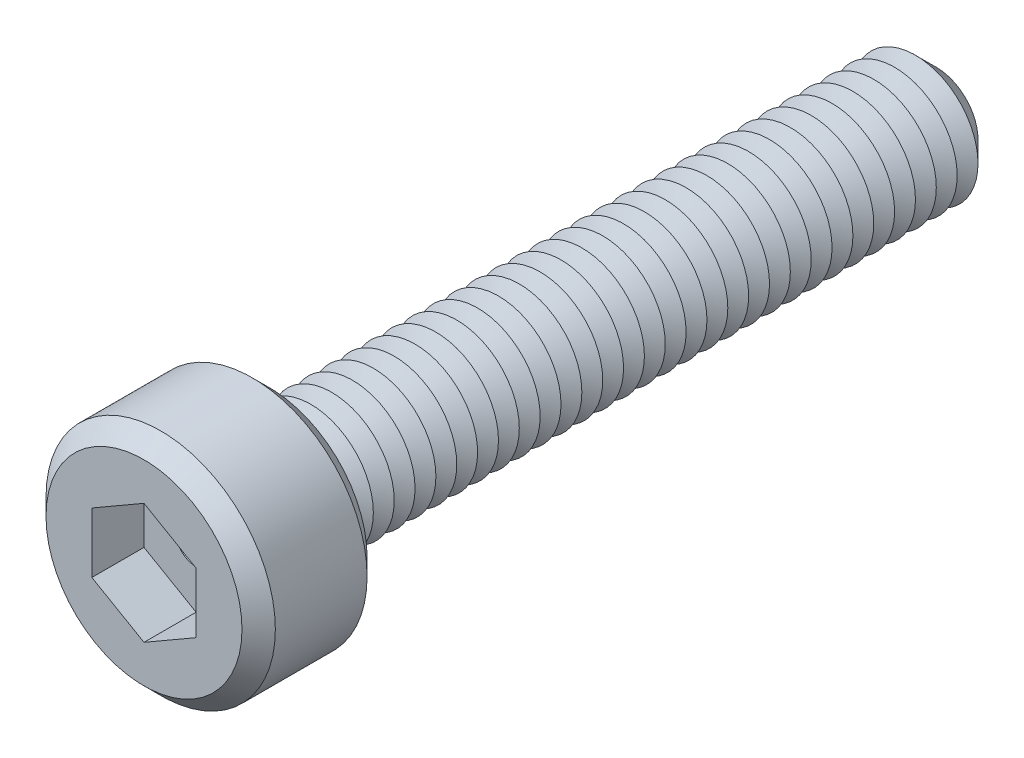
ISO-10303-21;
HEADER;
FILE_DESCRIPTION(('STEP AP214'),'2;1');
FILE_NAME('part.step','',(''),(''),'','','');
FILE_SCHEMA(('AUTOMOTIVE_DESIGN { 1 0 10303 214 1 1 1 1 }'));
ENDSEC;
DATA;
#1=APPLICATION_CONTEXT('core data for automotive mechanical design processes');
#2=APPLICATION_PROTOCOL_DEFINITION('international standard','automotive_design',2000,#1);
#3=PRODUCT_CONTEXT('',#1,'mechanical');
#4=PRODUCT('Part','Part','',(#3));
#5=PRODUCT_RELATED_PRODUCT_CATEGORY('part','',(#4));
#6=PRODUCT_DEFINITION_FORMATION('','',#4);
#7=PRODUCT_DEFINITION_CONTEXT('part definition',#1,'design');
#8=PRODUCT_DEFINITION('design','',#6,#7);
#9=PRODUCT_DEFINITION_SHAPE('','',#8);
#10=(LENGTH_UNIT() NAMED_UNIT(*) SI_UNIT(.MILLI.,.METRE.));
#11=(NAMED_UNIT(*) PLANE_ANGLE_UNIT() SI_UNIT($,.RADIAN.));
#12=(NAMED_UNIT(*) SI_UNIT($,.STERADIAN.) SOLID_ANGLE_UNIT());
#13=UNCERTAINTY_MEASURE_WITH_UNIT(LENGTH_MEASURE(1.E-05),#10,'distance_accuracy_value','');
#14=(GEOMETRIC_REPRESENTATION_CONTEXT(3) GLOBAL_UNCERTAINTY_ASSIGNED_CONTEXT((#13)) GLOBAL_UNIT_ASSIGNED_CONTEXT((#10,
#11,#12)) REPRESENTATION_CONTEXT('',''));
#15=CARTESIAN_POINT('',(0.,0.,0.));
#16=DIRECTION('',(0.,0.,1.));
#17=DIRECTION('',(1.,0.,0.));
#18=AXIS2_PLACEMENT_3D('',#15,#16,#17);
#19=CARTESIAN_POINT('',(0.,0.,3.));
#20=DIRECTION('',(0.,0.,-1.));
#21=DIRECTION('',(-1.,0.,0.));
#22=AXIS2_PLACEMENT_3D('',#19,#20,#21);
#23=CYLINDRICAL_SURFACE('',#22,2.75);
#24=CARTESIAN_POINT('',(0.,0.,0.400000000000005));
#25=DIRECTION('',(0.,0.,1.));
#26=DIRECTION('',(1.,0.,0.));
#27=AXIS2_PLACEMENT_3D('',#24,#25,#26);
#28=CIRCLE('',#27,2.75);
#29=CARTESIAN_POINT('',(2.75,0.,0.400000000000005));
#30=VERTEX_POINT('',#29);
#31=EDGE_CURVE('E424',#30,#30,#28,.T.);
#32=ORIENTED_EDGE('',*,*,#31,.T.);
#33=EDGE_LOOP('',(#32));
#34=FACE_BOUND('',#33,.T.);
#35=CARTESIAN_POINT('',(0.,0.,2.6));
#36=DIRECTION('',(0.,0.,1.));
#37=DIRECTION('',(1.,0.,0.));
#38=AXIS2_PLACEMENT_3D('',#35,#36,#37);
#39=CIRCLE('',#38,2.75);
#40=CARTESIAN_POINT('',(2.75,0.,2.6));
#41=VERTEX_POINT('',#40);
#42=EDGE_CURVE('E421',#41,#41,#39,.F.);
#43=ORIENTED_EDGE('',*,*,#42,.T.);
#44=EDGE_LOOP('',(#43));
#45=FACE_BOUND('',#44,.T.);
#46=ADVANCED_FACE('F39',(#34,#45),#23,.T.);
#47=CARTESIAN_POINT('',(0.,0.,3.));
#48=DIRECTION('',(0.,0.,1.));
#49=DIRECTION('',(1.,0.,0.));
#50=AXIS2_PLACEMENT_3D('',#47,#48,#49);
#51=PLANE('',#50);
#52=CARTESIAN_POINT('',(0.,0.,3.));
#53=DIRECTION('',(0.,0.,1.));
#54=DIRECTION('',(1.,0.,0.));
#55=AXIS2_PLACEMENT_3D('',#52,#53,#54);
#56=CIRCLE('',#55,2.35);
#57=CARTESIAN_POINT('',(2.35,0.,3.));
#58=VERTEX_POINT('',#57);
#59=EDGE_CURVE('E11',#58,#58,#56,.T.);
#60=ORIENTED_EDGE('',*,*,#59,.T.);
#61=EDGE_LOOP('',(#60));
#62=FACE_BOUND('',#61,.T.);
#63=DIRECTION('',(-0.866025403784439,0.5,0.));
#64=VECTOR('',#63,1.);
#65=CARTESIAN_POINT('',(1.25,0.721687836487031,3.));
#66=LINE('',#65,#64);
#67=CARTESIAN_POINT('',(1.25,0.721687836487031,3.));
#68=VERTEX_POINT('',#67);
#69=CARTESIAN_POINT('',(0.,1.44337567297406,3.));
#70=VERTEX_POINT('',#69);
#71=EDGE_CURVE('E55',#68,#70,#66,.T.);
#72=ORIENTED_EDGE('',*,*,#71,.F.);
#73=DIRECTION('',(0.,1.,0.));
#74=VECTOR('',#73,1.);
#75=CARTESIAN_POINT('',(1.25,-0.721687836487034,3.));
#76=LINE('',#75,#74);
#77=CARTESIAN_POINT('',(1.25,-0.721687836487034,3.));
#78=VERTEX_POINT('',#77);
#79=EDGE_CURVE('E151',#78,#68,#76,.T.);
#80=ORIENTED_EDGE('',*,*,#79,.F.);
#81=DIRECTION('',(0.866025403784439,0.5,0.));
#82=VECTOR('',#81,1.);
#83=CARTESIAN_POINT('',(0.,-1.44337567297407,3.));
#84=LINE('',#83,#82);
#85=CARTESIAN_POINT('',(0.,-1.44337567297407,3.));
#86=VERTEX_POINT('',#85);
#87=EDGE_CURVE('E148',#86,#78,#84,.T.);
#88=ORIENTED_EDGE('',*,*,#87,.F.);
#89=DIRECTION('',(0.866025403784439,-0.5,0.));
#90=VECTOR('',#89,1.);
#91=CARTESIAN_POINT('',(-1.25,-0.721687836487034,3.));
#92=LINE('',#91,#90);
#93=CARTESIAN_POINT('',(-1.25,-0.721687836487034,3.));
#94=VERTEX_POINT('',#93);
#95=EDGE_CURVE('E103',#94,#86,#92,.T.);
#96=ORIENTED_EDGE('',*,*,#95,.F.);
#97=DIRECTION('',(0.,-1.,0.));
#98=VECTOR('',#97,1.);
#99=CARTESIAN_POINT('',(-1.25,0.721687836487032,3.));
#100=LINE('',#99,#98);
#101=CARTESIAN_POINT('',(-1.25,0.721687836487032,3.));
#102=VERTEX_POINT('',#101);
#103=EDGE_CURVE('E142',#102,#94,#100,.T.);
#104=ORIENTED_EDGE('',*,*,#103,.F.);
#105=DIRECTION('',(-0.866025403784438,-0.5,0.));
#106=VECTOR('',#105,1.);
#107=CARTESIAN_POINT('',(0.,1.44337567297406,3.));
#108=LINE('',#107,#106);
#109=EDGE_CURVE('E137',#70,#102,#108,.T.);
#110=ORIENTED_EDGE('',*,*,#109,.F.);
#111=EDGE_LOOP('',(#72,#80,#88,#96,#104,#110));
#112=FACE_BOUND('',#111,.T.);
#113=ADVANCED_FACE('F442',(#62,#112),#51,.T.);
#114=CARTESIAN_POINT('',(0.,0.,0.));
#115=DIRECTION('',(0.,0.,1.));
#116=DIRECTION('',(1.,0.,0.));
#117=AXIS2_PLACEMENT_3D('',#114,#115,#116);
#118=PLANE('',#117);
#119=CARTESIAN_POINT('',(0.,0.,0.));
#120=DIRECTION('',(0.,0.,1.));
#121=DIRECTION('',(1.,0.,0.));
#122=AXIS2_PLACEMENT_3D('',#119,#120,#121);
#123=CIRCLE('',#122,2.34999999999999);
#124=CARTESIAN_POINT('',(2.34999999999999,0.,0.));
#125=VERTEX_POINT('',#124);
#126=EDGE_CURVE('E48',#125,#125,#123,.F.);
#127=ORIENTED_EDGE('',*,*,#126,.T.);
#128=EDGE_LOOP('',(#127));
#129=FACE_BOUND('',#128,.T.);
#130=CARTESIAN_POINT('',(0.,0.,0.));
#131=DIRECTION('',(0.,0.,1.));
#132=DIRECTION('',(1.,0.,0.));
#133=AXIS2_PLACEMENT_3D('',#130,#131,#132);
#134=CIRCLE('',#133,1.5);
#135=CARTESIAN_POINT('',(1.5,0.,0.));
#136=VERTEX_POINT('',#135);
#137=EDGE_CURVE('E413',#136,#136,#134,.T.);
#138=ORIENTED_EDGE('',*,*,#137,.T.);
#139=EDGE_LOOP('',(#138));
#140=FACE_BOUND('',#139,.T.);
#141=ADVANCED_FACE('F431',(#129,#140),#118,.F.);
#142=CARTESIAN_POINT('',(0.,0.,0.));
#143=DIRECTION('',(0.,0.,1.));
#144=DIRECTION('',(1.,0.,0.));
#145=AXIS2_PLACEMENT_3D('',#142,#143,#144);
#146=CONICAL_SURFACE('',#145,1.5,1.0471975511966);
#147=CARTESIAN_POINT('',(0.,0.,-0.250000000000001));
#148=DIRECTION('',(0.,0.,1.));
#149=DIRECTION('',(1.,0.,0.));
#150=AXIS2_PLACEMENT_3D('',#147,#148,#149);
#151=CIRCLE('',#150,1.06698729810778);
#152=CARTESIAN_POINT('',(1.06698729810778,0.,-0.250000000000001));
#153=VERTEX_POINT('',#152);
#154=EDGE_CURVE('E409',#153,#153,#151,.T.);
#155=ORIENTED_EDGE('',*,*,#154,.T.);
#156=EDGE_LOOP('',(#155));
#157=FACE_BOUND('',#156,.T.);
#158=ORIENTED_EDGE('',*,*,#137,.F.);
#159=EDGE_LOOP('',(#158));
#160=FACE_BOUND('',#159,.T.);
#161=ADVANCED_FACE('F740',(#157,#160),#146,.T.);
#162=CARTESIAN_POINT('',(0.,0.,-0.250000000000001));
#163=DIRECTION('',(0.,0.,-1.));
#164=DIRECTION('',(-1.,0.,0.));
#165=AXIS2_PLACEMENT_3D('',#162,#163,#164);
#166=CONICAL_SURFACE('',#165,1.06698729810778,1.0471975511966);
#167=CARTESIAN_POINT('',(0.,0.,-0.5));
#168=DIRECTION('',(0.,0.,1.));
#169=DIRECTION('',(1.,0.,0.));
#170=AXIS2_PLACEMENT_3D('',#167,#168,#169);
#171=CIRCLE('',#170,1.5);
#172=CARTESIAN_POINT('',(1.5,0.,-0.5));
#173=VERTEX_POINT('',#172);
#174=EDGE_CURVE('E405',#173,#173,#171,.T.);
#175=ORIENTED_EDGE('',*,*,#174,.T.);
#176=EDGE_LOOP('',(#175));
#177=FACE_BOUND('',#176,.T.);
#178=ORIENTED_EDGE('',*,*,#154,.F.);
#179=EDGE_LOOP('',(#178));
#180=FACE_BOUND('',#179,.T.);
#181=ADVANCED_FACE('F736',(#177,#180),#166,.T.);
#182=CARTESIAN_POINT('',(0.,0.,-0.5));
#183=DIRECTION('',(0.,0.,1.));
#184=DIRECTION('',(1.,0.,0.));
#185=AXIS2_PLACEMENT_3D('',#182,#183,#184);
#186=CONICAL_SURFACE('',#185,1.5,1.0471975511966);
#187=CARTESIAN_POINT('',(0.,0.,-0.750000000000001));
#188=DIRECTION('',(0.,0.,1.));
#189=DIRECTION('',(1.,0.,0.));
#190=AXIS2_PLACEMENT_3D('',#187,#188,#189);
#191=CIRCLE('',#190,1.06698729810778);
#192=CARTESIAN_POINT('',(1.06698729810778,0.,-0.750000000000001));
#193=VERTEX_POINT('',#192);
#194=EDGE_CURVE('E401',#193,#193,#191,.T.);
#195=ORIENTED_EDGE('',*,*,#194,.T.);
#196=EDGE_LOOP('',(#195));
#197=FACE_BOUND('',#196,.T.);
#198=ORIENTED_EDGE('',*,*,#174,.F.);
#199=EDGE_LOOP('',(#198));
#200=FACE_BOUND('',#199,.T.);
#201=ADVANCED_FACE('F732',(#197,#200),#186,.T.);
#202=CARTESIAN_POINT('',(0.,0.,-0.750000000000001));
#203=DIRECTION('',(0.,0.,-1.));
#204=DIRECTION('',(-1.,0.,0.));
#205=AXIS2_PLACEMENT_3D('',#202,#203,#204);
#206=CONICAL_SURFACE('',#205,1.06698729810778,1.0471975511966);
#207=CARTESIAN_POINT('',(0.,0.,-1.));
#208=DIRECTION('',(0.,0.,1.));
#209=DIRECTION('',(1.,0.,0.));
#210=AXIS2_PLACEMENT_3D('',#207,#208,#209);
#211=CIRCLE('',#210,1.5);
#212=CARTESIAN_POINT('',(1.5,0.,-1.));
#213=VERTEX_POINT('',#212);
#214=EDGE_CURVE('E397',#213,#213,#211,.T.);
#215=ORIENTED_EDGE('',*,*,#214,.T.);
#216=EDGE_LOOP('',(#215));
#217=FACE_BOUND('',#216,.T.);
#218=ORIENTED_EDGE('',*,*,#194,.F.);
#219=EDGE_LOOP('',(#218));
#220=FACE_BOUND('',#219,.T.);
#221=ADVANCED_FACE('F728',(#217,#220),#206,.T.);
#222=CARTESIAN_POINT('',(0.,0.,-1.));
#223=DIRECTION('',(0.,0.,1.));
#224=DIRECTION('',(1.,0.,0.));
#225=AXIS2_PLACEMENT_3D('',#222,#223,#224);
#226=CONICAL_SURFACE('',#225,1.5,1.0471975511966);
#227=CARTESIAN_POINT('',(0.,0.,-1.25));
#228=DIRECTION('',(0.,0.,1.));
#229=DIRECTION('',(1.,0.,0.));
#230=AXIS2_PLACEMENT_3D('',#227,#228,#229);
#231=CIRCLE('',#230,1.06698729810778);
#232=CARTESIAN_POINT('',(1.06698729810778,0.,-1.25));
#233=VERTEX_POINT('',#232);
#234=EDGE_CURVE('E393',#233,#233,#231,.T.);
#235=ORIENTED_EDGE('',*,*,#234,.T.);
#236=EDGE_LOOP('',(#235));
#237=FACE_BOUND('',#236,.T.);
#238=ORIENTED_EDGE('',*,*,#214,.F.);
#239=EDGE_LOOP('',(#238));
#240=FACE_BOUND('',#239,.T.);
#241=ADVANCED_FACE('F724',(#237,#240),#226,.T.);
#242=CARTESIAN_POINT('',(0.,0.,-1.25));
#243=DIRECTION('',(0.,0.,-1.));
#244=DIRECTION('',(-1.,0.,0.));
#245=AXIS2_PLACEMENT_3D('',#242,#243,#244);
#246=CONICAL_SURFACE('',#245,1.06698729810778,1.0471975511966);
#247=CARTESIAN_POINT('',(0.,0.,-1.5));
#248=DIRECTION('',(0.,0.,1.));
#249=DIRECTION('',(1.,0.,0.));
#250=AXIS2_PLACEMENT_3D('',#247,#248,#249);
#251=CIRCLE('',#250,1.5);
#252=CARTESIAN_POINT('',(1.5,0.,-1.5));
#253=VERTEX_POINT('',#252);
#254=EDGE_CURVE('E389',#253,#253,#251,.T.);
#255=ORIENTED_EDGE('',*,*,#254,.T.);
#256=EDGE_LOOP('',(#255));
#257=FACE_BOUND('',#256,.T.);
#258=ORIENTED_EDGE('',*,*,#234,.F.);
#259=EDGE_LOOP('',(#258));
#260=FACE_BOUND('',#259,.T.);
#261=ADVANCED_FACE('F720',(#257,#260),#246,.T.);
#262=CARTESIAN_POINT('',(0.,0.,-1.5));
#263=DIRECTION('',(0.,0.,1.));
#264=DIRECTION('',(1.,0.,0.));
#265=AXIS2_PLACEMENT_3D('',#262,#263,#264);
#266=CONICAL_SURFACE('',#265,1.5,1.0471975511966);
#267=CARTESIAN_POINT('',(0.,0.,-1.75));
#268=DIRECTION('',(0.,0.,1.));
#269=DIRECTION('',(1.,0.,0.));
#270=AXIS2_PLACEMENT_3D('',#267,#268,#269);
#271=CIRCLE('',#270,1.06698729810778);
#272=CARTESIAN_POINT('',(1.06698729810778,0.,-1.75));
#273=VERTEX_POINT('',#272);
#274=EDGE_CURVE('E385',#273,#273,#271,.T.);
#275=ORIENTED_EDGE('',*,*,#274,.T.);
#276=EDGE_LOOP('',(#275));
#277=FACE_BOUND('',#276,.T.);
#278=ORIENTED_EDGE('',*,*,#254,.F.);
#279=EDGE_LOOP('',(#278));
#280=FACE_BOUND('',#279,.T.);
#281=ADVANCED_FACE('F716',(#277,#280),#266,.T.);
#282=CARTESIAN_POINT('',(0.,0.,-1.75));
#283=DIRECTION('',(0.,0.,-1.));
#284=DIRECTION('',(-1.,0.,0.));
#285=AXIS2_PLACEMENT_3D('',#282,#283,#284);
#286=CONICAL_SURFACE('',#285,1.06698729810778,1.0471975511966);
#287=CARTESIAN_POINT('',(0.,0.,-2.));
#288=DIRECTION('',(0.,0.,1.));
#289=DIRECTION('',(1.,0.,0.));
#290=AXIS2_PLACEMENT_3D('',#287,#288,#289);
#291=CIRCLE('',#290,1.5);
#292=CARTESIAN_POINT('',(1.5,0.,-2.));
#293=VERTEX_POINT('',#292);
#294=EDGE_CURVE('E381',#293,#293,#291,.T.);
#295=ORIENTED_EDGE('',*,*,#294,.T.);
#296=EDGE_LOOP('',(#295));
#297=FACE_BOUND('',#296,.T.);
#298=ORIENTED_EDGE('',*,*,#274,.F.);
#299=EDGE_LOOP('',(#298));
#300=FACE_BOUND('',#299,.T.);
#301=ADVANCED_FACE('F712',(#297,#300),#286,.T.);
#302=CARTESIAN_POINT('',(0.,0.,-2.));
#303=DIRECTION('',(0.,0.,1.));
#304=DIRECTION('',(1.,0.,0.));
#305=AXIS2_PLACEMENT_3D('',#302,#303,#304);
#306=CONICAL_SURFACE('',#305,1.5,1.0471975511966);
#307=CARTESIAN_POINT('',(0.,0.,-2.25));
#308=DIRECTION('',(0.,0.,1.));
#309=DIRECTION('',(1.,0.,0.));
#310=AXIS2_PLACEMENT_3D('',#307,#308,#309);
#311=CIRCLE('',#310,1.06698729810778);
#312=CARTESIAN_POINT('',(1.06698729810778,0.,-2.25));
#313=VERTEX_POINT('',#312);
#314=EDGE_CURVE('E377',#313,#313,#311,.T.);
#315=ORIENTED_EDGE('',*,*,#314,.T.);
#316=EDGE_LOOP('',(#315));
#317=FACE_BOUND('',#316,.T.);
#318=ORIENTED_EDGE('',*,*,#294,.F.);
#319=EDGE_LOOP('',(#318));
#320=FACE_BOUND('',#319,.T.);
#321=ADVANCED_FACE('F708',(#317,#320),#306,.T.);
#322=CARTESIAN_POINT('',(0.,0.,-2.25));
#323=DIRECTION('',(0.,0.,-1.));
#324=DIRECTION('',(-1.,0.,0.));
#325=AXIS2_PLACEMENT_3D('',#322,#323,#324);
#326=CONICAL_SURFACE('',#325,1.06698729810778,1.0471975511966);
#327=CARTESIAN_POINT('',(0.,0.,-2.5));
#328=DIRECTION('',(0.,0.,1.));
#329=DIRECTION('',(1.,0.,0.));
#330=AXIS2_PLACEMENT_3D('',#327,#328,#329);
#331=CIRCLE('',#330,1.5);
#332=CARTESIAN_POINT('',(1.5,0.,-2.5));
#333=VERTEX_POINT('',#332);
#334=EDGE_CURVE('E373',#333,#333,#331,.T.);
#335=ORIENTED_EDGE('',*,*,#334,.T.);
#336=EDGE_LOOP('',(#335));
#337=FACE_BOUND('',#336,.T.);
#338=ORIENTED_EDGE('',*,*,#314,.F.);
#339=EDGE_LOOP('',(#338));
#340=FACE_BOUND('',#339,.T.);
#341=ADVANCED_FACE('F704',(#337,#340),#326,.T.);
#342=CARTESIAN_POINT('',(0.,0.,-2.5));
#343=DIRECTION('',(0.,0.,1.));
#344=DIRECTION('',(1.,0.,0.));
#345=AXIS2_PLACEMENT_3D('',#342,#343,#344);
#346=CONICAL_SURFACE('',#345,1.5,1.0471975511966);
#347=CARTESIAN_POINT('',(0.,0.,-2.75));
#348=DIRECTION('',(0.,0.,1.));
#349=DIRECTION('',(1.,0.,0.));
#350=AXIS2_PLACEMENT_3D('',#347,#348,#349);
#351=CIRCLE('',#350,1.06698729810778);
#352=CARTESIAN_POINT('',(1.06698729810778,0.,-2.75));
#353=VERTEX_POINT('',#352);
#354=EDGE_CURVE('E369',#353,#353,#351,.T.);
#355=ORIENTED_EDGE('',*,*,#354,.T.);
#356=EDGE_LOOP('',(#355));
#357=FACE_BOUND('',#356,.T.);
#358=ORIENTED_EDGE('',*,*,#334,.F.);
#359=EDGE_LOOP('',(#358));
#360=FACE_BOUND('',#359,.T.);
#361=ADVANCED_FACE('F700',(#357,#360),#346,.T.);
#362=CARTESIAN_POINT('',(0.,0.,-2.75));
#363=DIRECTION('',(0.,0.,-1.));
#364=DIRECTION('',(-1.,0.,0.));
#365=AXIS2_PLACEMENT_3D('',#362,#363,#364);
#366=CONICAL_SURFACE('',#365,1.06698729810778,1.0471975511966);
#367=CARTESIAN_POINT('',(0.,0.,-3.));
#368=DIRECTION('',(0.,0.,1.));
#369=DIRECTION('',(1.,0.,0.));
#370=AXIS2_PLACEMENT_3D('',#367,#368,#369);
#371=CIRCLE('',#370,1.5);
#372=CARTESIAN_POINT('',(1.5,0.,-3.));
#373=VERTEX_POINT('',#372);
#374=EDGE_CURVE('E365',#373,#373,#371,.T.);
#375=ORIENTED_EDGE('',*,*,#374,.T.);
#376=EDGE_LOOP('',(#375));
#377=FACE_BOUND('',#376,.T.);
#378=ORIENTED_EDGE('',*,*,#354,.F.);
#379=EDGE_LOOP('',(#378));
#380=FACE_BOUND('',#379,.T.);
#381=ADVANCED_FACE('F696',(#377,#380),#366,.T.);
#382=CARTESIAN_POINT('',(0.,0.,-3.));
#383=DIRECTION('',(0.,0.,1.));
#384=DIRECTION('',(1.,0.,0.));
#385=AXIS2_PLACEMENT_3D('',#382,#383,#384);
#386=CONICAL_SURFACE('',#385,1.5,1.0471975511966);
#387=CARTESIAN_POINT('',(0.,0.,-3.25));
#388=DIRECTION('',(0.,0.,1.));
#389=DIRECTION('',(1.,0.,0.));
#390=AXIS2_PLACEMENT_3D('',#387,#388,#389);
#391=CIRCLE('',#390,1.06698729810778);
#392=CARTESIAN_POINT('',(1.06698729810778,0.,-3.25));
#393=VERTEX_POINT('',#392);
#394=EDGE_CURVE('E361',#393,#393,#391,.T.);
#395=ORIENTED_EDGE('',*,*,#394,.T.);
#396=EDGE_LOOP('',(#395));
#397=FACE_BOUND('',#396,.T.);
#398=ORIENTED_EDGE('',*,*,#374,.F.);
#399=EDGE_LOOP('',(#398));
#400=FACE_BOUND('',#399,.T.);
#401=ADVANCED_FACE('F692',(#397,#400),#386,.T.);
#402=CARTESIAN_POINT('',(0.,0.,-3.25));
#403=DIRECTION('',(0.,0.,-1.));
#404=DIRECTION('',(-1.,0.,0.));
#405=AXIS2_PLACEMENT_3D('',#402,#403,#404);
#406=CONICAL_SURFACE('',#405,1.06698729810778,1.0471975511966);
#407=CARTESIAN_POINT('',(0.,0.,-3.5));
#408=DIRECTION('',(0.,0.,1.));
#409=DIRECTION('',(1.,0.,0.));
#410=AXIS2_PLACEMENT_3D('',#407,#408,#409);
#411=CIRCLE('',#410,1.5);
#412=CARTESIAN_POINT('',(1.5,0.,-3.5));
#413=VERTEX_POINT('',#412);
#414=EDGE_CURVE('E357',#413,#413,#411,.T.);
#415=ORIENTED_EDGE('',*,*,#414,.T.);
#416=EDGE_LOOP('',(#415));
#417=FACE_BOUND('',#416,.T.);
#418=ORIENTED_EDGE('',*,*,#394,.F.);
#419=EDGE_LOOP('',(#418));
#420=FACE_BOUND('',#419,.T.);
#421=ADVANCED_FACE('F688',(#417,#420),#406,.T.);
#422=CARTESIAN_POINT('',(0.,0.,-3.5));
#423=DIRECTION('',(0.,0.,1.));
#424=DIRECTION('',(1.,0.,0.));
#425=AXIS2_PLACEMENT_3D('',#422,#423,#424);
#426=CONICAL_SURFACE('',#425,1.5,1.0471975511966);
#427=CARTESIAN_POINT('',(0.,0.,-3.75));
#428=DIRECTION('',(0.,0.,1.));
#429=DIRECTION('',(1.,0.,0.));
#430=AXIS2_PLACEMENT_3D('',#427,#428,#429);
#431=CIRCLE('',#430,1.06698729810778);
#432=CARTESIAN_POINT('',(1.06698729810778,0.,-3.75));
#433=VERTEX_POINT('',#432);
#434=EDGE_CURVE('E353',#433,#433,#431,.T.);
#435=ORIENTED_EDGE('',*,*,#434,.T.);
#436=EDGE_LOOP('',(#435));
#437=FACE_BOUND('',#436,.T.);
#438=ORIENTED_EDGE('',*,*,#414,.F.);
#439=EDGE_LOOP('',(#438));
#440=FACE_BOUND('',#439,.T.);
#441=ADVANCED_FACE('F684',(#437,#440),#426,.T.);
#442=CARTESIAN_POINT('',(0.,0.,-3.75));
#443=DIRECTION('',(0.,0.,-1.));
#444=DIRECTION('',(-1.,0.,0.));
#445=AXIS2_PLACEMENT_3D('',#442,#443,#444);
#446=CONICAL_SURFACE('',#445,1.06698729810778,1.0471975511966);
#447=CARTESIAN_POINT('',(0.,0.,-4.));
#448=DIRECTION('',(0.,0.,1.));
#449=DIRECTION('',(1.,0.,0.));
#450=AXIS2_PLACEMENT_3D('',#447,#448,#449);
#451=CIRCLE('',#450,1.5);
#452=CARTESIAN_POINT('',(1.5,0.,-4.));
#453=VERTEX_POINT('',#452);
#454=EDGE_CURVE('E349',#453,#453,#451,.T.);
#455=ORIENTED_EDGE('',*,*,#454,.T.);
#456=EDGE_LOOP('',(#455));
#457=FACE_BOUND('',#456,.T.);
#458=ORIENTED_EDGE('',*,*,#434,.F.);
#459=EDGE_LOOP('',(#458));
#460=FACE_BOUND('',#459,.T.);
#461=ADVANCED_FACE('F680',(#457,#460),#446,.T.);
#462=CARTESIAN_POINT('',(0.,0.,-4.));
#463=DIRECTION('',(0.,0.,1.));
#464=DIRECTION('',(1.,0.,0.));
#465=AXIS2_PLACEMENT_3D('',#462,#463,#464);
#466=CONICAL_SURFACE('',#465,1.5,1.0471975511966);
#467=CARTESIAN_POINT('',(0.,0.,-4.25));
#468=DIRECTION('',(0.,0.,1.));
#469=DIRECTION('',(1.,0.,0.));
#470=AXIS2_PLACEMENT_3D('',#467,#468,#469);
#471=CIRCLE('',#470,1.06698729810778);
#472=CARTESIAN_POINT('',(1.06698729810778,0.,-4.25));
#473=VERTEX_POINT('',#472);
#474=EDGE_CURVE('E345',#473,#473,#471,.T.);
#475=ORIENTED_EDGE('',*,*,#474,.T.);
#476=EDGE_LOOP('',(#475));
#477=FACE_BOUND('',#476,.T.);
#478=ORIENTED_EDGE('',*,*,#454,.F.);
#479=EDGE_LOOP('',(#478));
#480=FACE_BOUND('',#479,.T.);
#481=ADVANCED_FACE('F676',(#477,#480),#466,.T.);
#482=CARTESIAN_POINT('',(0.,0.,-4.25));
#483=DIRECTION('',(0.,0.,-1.));
#484=DIRECTION('',(-1.,0.,0.));
#485=AXIS2_PLACEMENT_3D('',#482,#483,#484);
#486=CONICAL_SURFACE('',#485,1.06698729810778,1.0471975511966);
#487=CARTESIAN_POINT('',(0.,0.,-4.5));
#488=DIRECTION('',(0.,0.,1.));
#489=DIRECTION('',(1.,0.,0.));
#490=AXIS2_PLACEMENT_3D('',#487,#488,#489);
#491=CIRCLE('',#490,1.5);
#492=CARTESIAN_POINT('',(1.5,0.,-4.5));
#493=VERTEX_POINT('',#492);
#494=EDGE_CURVE('E341',#493,#493,#491,.T.);
#495=ORIENTED_EDGE('',*,*,#494,.T.);
#496=EDGE_LOOP('',(#495));
#497=FACE_BOUND('',#496,.T.);
#498=ORIENTED_EDGE('',*,*,#474,.F.);
#499=EDGE_LOOP('',(#498));
#500=FACE_BOUND('',#499,.T.);
#501=ADVANCED_FACE('F672',(#497,#500),#486,.T.);
#502=CARTESIAN_POINT('',(0.,0.,-4.5));
#503=DIRECTION('',(0.,0.,1.));
#504=DIRECTION('',(1.,0.,0.));
#505=AXIS2_PLACEMENT_3D('',#502,#503,#504);
#506=CONICAL_SURFACE('',#505,1.5,1.0471975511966);
#507=CARTESIAN_POINT('',(0.,0.,-4.75));
#508=DIRECTION('',(0.,0.,1.));
#509=DIRECTION('',(1.,0.,0.));
#510=AXIS2_PLACEMENT_3D('',#507,#508,#509);
#511=CIRCLE('',#510,1.06698729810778);
#512=CARTESIAN_POINT('',(1.06698729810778,0.,-4.75));
#513=VERTEX_POINT('',#512);
#514=EDGE_CURVE('E337',#513,#513,#511,.T.);
#515=ORIENTED_EDGE('',*,*,#514,.T.);
#516=EDGE_LOOP('',(#515));
#517=FACE_BOUND('',#516,.T.);
#518=ORIENTED_EDGE('',*,*,#494,.F.);
#519=EDGE_LOOP('',(#518));
#520=FACE_BOUND('',#519,.T.);
#521=ADVANCED_FACE('F668',(#517,#520),#506,.T.);
#522=CARTESIAN_POINT('',(0.,0.,-4.75));
#523=DIRECTION('',(0.,0.,-1.));
#524=DIRECTION('',(-1.,0.,0.));
#525=AXIS2_PLACEMENT_3D('',#522,#523,#524);
#526=CONICAL_SURFACE('',#525,1.06698729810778,1.0471975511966);
#527=CARTESIAN_POINT('',(0.,0.,-5.));
#528=DIRECTION('',(0.,0.,1.));
#529=DIRECTION('',(1.,0.,0.));
#530=AXIS2_PLACEMENT_3D('',#527,#528,#529);
#531=CIRCLE('',#530,1.5);
#532=CARTESIAN_POINT('',(1.5,0.,-5.));
#533=VERTEX_POINT('',#532);
#534=EDGE_CURVE('E333',#533,#533,#531,.T.);
#535=ORIENTED_EDGE('',*,*,#534,.T.);
#536=EDGE_LOOP('',(#535));
#537=FACE_BOUND('',#536,.T.);
#538=ORIENTED_EDGE('',*,*,#514,.F.);
#539=EDGE_LOOP('',(#538));
#540=FACE_BOUND('',#539,.T.);
#541=ADVANCED_FACE('F664',(#537,#540),#526,.T.);
#542=CARTESIAN_POINT('',(0.,0.,-5.));
#543=DIRECTION('',(0.,0.,1.));
#544=DIRECTION('',(1.,0.,0.));
#545=AXIS2_PLACEMENT_3D('',#542,#543,#544);
#546=CONICAL_SURFACE('',#545,1.5,1.0471975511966);
#547=CARTESIAN_POINT('',(0.,0.,-5.25));
#548=DIRECTION('',(0.,0.,1.));
#549=DIRECTION('',(1.,0.,0.));
#550=AXIS2_PLACEMENT_3D('',#547,#548,#549);
#551=CIRCLE('',#550,1.06698729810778);
#552=CARTESIAN_POINT('',(1.06698729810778,0.,-5.25));
#553=VERTEX_POINT('',#552);
#554=EDGE_CURVE('E329',#553,#553,#551,.T.);
#555=ORIENTED_EDGE('',*,*,#554,.T.);
#556=EDGE_LOOP('',(#555));
#557=FACE_BOUND('',#556,.T.);
#558=ORIENTED_EDGE('',*,*,#534,.F.);
#559=EDGE_LOOP('',(#558));
#560=FACE_BOUND('',#559,.T.);
#561=ADVANCED_FACE('F660',(#557,#560),#546,.T.);
#562=CARTESIAN_POINT('',(0.,0.,-5.25));
#563=DIRECTION('',(0.,0.,-1.));
#564=DIRECTION('',(-1.,0.,0.));
#565=AXIS2_PLACEMENT_3D('',#562,#563,#564);
#566=CONICAL_SURFACE('',#565,1.06698729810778,1.0471975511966);
#567=CARTESIAN_POINT('',(0.,0.,-5.5));
#568=DIRECTION('',(0.,0.,1.));
#569=DIRECTION('',(1.,0.,0.));
#570=AXIS2_PLACEMENT_3D('',#567,#568,#569);
#571=CIRCLE('',#570,1.5);
#572=CARTESIAN_POINT('',(1.5,0.,-5.5));
#573=VERTEX_POINT('',#572);
#574=EDGE_CURVE('E325',#573,#573,#571,.T.);
#575=ORIENTED_EDGE('',*,*,#574,.T.);
#576=EDGE_LOOP('',(#575));
#577=FACE_BOUND('',#576,.T.);
#578=ORIENTED_EDGE('',*,*,#554,.F.);
#579=EDGE_LOOP('',(#578));
#580=FACE_BOUND('',#579,.T.);
#581=ADVANCED_FACE('F656',(#577,#580),#566,.T.);
#582=CARTESIAN_POINT('',(0.,0.,-5.5));
#583=DIRECTION('',(0.,0.,1.));
#584=DIRECTION('',(1.,0.,0.));
#585=AXIS2_PLACEMENT_3D('',#582,#583,#584);
#586=CONICAL_SURFACE('',#585,1.5,1.0471975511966);
#587=CARTESIAN_POINT('',(0.,0.,-5.75));
#588=DIRECTION('',(0.,0.,1.));
#589=DIRECTION('',(1.,0.,0.));
#590=AXIS2_PLACEMENT_3D('',#587,#588,#589);
#591=CIRCLE('',#590,1.06698729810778);
#592=CARTESIAN_POINT('',(1.06698729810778,0.,-5.75));
#593=VERTEX_POINT('',#592);
#594=EDGE_CURVE('E321',#593,#593,#591,.T.);
#595=ORIENTED_EDGE('',*,*,#594,.T.);
#596=EDGE_LOOP('',(#595));
#597=FACE_BOUND('',#596,.T.);
#598=ORIENTED_EDGE('',*,*,#574,.F.);
#599=EDGE_LOOP('',(#598));
#600=FACE_BOUND('',#599,.T.);
#601=ADVANCED_FACE('F652',(#597,#600),#586,.T.);
#602=CARTESIAN_POINT('',(0.,0.,-5.75));
#603=DIRECTION('',(0.,0.,-1.));
#604=DIRECTION('',(-1.,0.,0.));
#605=AXIS2_PLACEMENT_3D('',#602,#603,#604);
#606=CONICAL_SURFACE('',#605,1.06698729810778,1.0471975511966);
#607=CARTESIAN_POINT('',(0.,0.,-6.));
#608=DIRECTION('',(0.,0.,1.));
#609=DIRECTION('',(1.,0.,0.));
#610=AXIS2_PLACEMENT_3D('',#607,#608,#609);
#611=CIRCLE('',#610,1.5);
#612=CARTESIAN_POINT('',(1.5,0.,-6.));
#613=VERTEX_POINT('',#612);
#614=EDGE_CURVE('E317',#613,#613,#611,.T.);
#615=ORIENTED_EDGE('',*,*,#614,.T.);
#616=EDGE_LOOP('',(#615));
#617=FACE_BOUND('',#616,.T.);
#618=ORIENTED_EDGE('',*,*,#594,.F.);
#619=EDGE_LOOP('',(#618));
#620=FACE_BOUND('',#619,.T.);
#621=ADVANCED_FACE('F648',(#617,#620),#606,.T.);
#622=CARTESIAN_POINT('',(0.,0.,-6.));
#623=DIRECTION('',(0.,0.,1.));
#624=DIRECTION('',(1.,0.,0.));
#625=AXIS2_PLACEMENT_3D('',#622,#623,#624);
#626=CONICAL_SURFACE('',#625,1.5,1.0471975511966);
#627=CARTESIAN_POINT('',(0.,0.,-6.25));
#628=DIRECTION('',(0.,0.,1.));
#629=DIRECTION('',(1.,0.,0.));
#630=AXIS2_PLACEMENT_3D('',#627,#628,#629);
#631=CIRCLE('',#630,1.06698729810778);
#632=CARTESIAN_POINT('',(1.06698729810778,0.,-6.25));
#633=VERTEX_POINT('',#632);
#634=EDGE_CURVE('E313',#633,#633,#631,.T.);
#635=ORIENTED_EDGE('',*,*,#634,.T.);
#636=EDGE_LOOP('',(#635));
#637=FACE_BOUND('',#636,.T.);
#638=ORIENTED_EDGE('',*,*,#614,.F.);
#639=EDGE_LOOP('',(#638));
#640=FACE_BOUND('',#639,.T.);
#641=ADVANCED_FACE('F644',(#637,#640),#626,.T.);
#642=CARTESIAN_POINT('',(0.,0.,-6.25));
#643=DIRECTION('',(0.,0.,-1.));
#644=DIRECTION('',(-1.,0.,0.));
#645=AXIS2_PLACEMENT_3D('',#642,#643,#644);
#646=CONICAL_SURFACE('',#645,1.06698729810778,1.0471975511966);
#647=CARTESIAN_POINT('',(0.,0.,-6.5));
#648=DIRECTION('',(0.,0.,1.));
#649=DIRECTION('',(1.,0.,0.));
#650=AXIS2_PLACEMENT_3D('',#647,#648,#649);
#651=CIRCLE('',#650,1.5);
#652=CARTESIAN_POINT('',(1.5,0.,-6.5));
#653=VERTEX_POINT('',#652);
#654=EDGE_CURVE('E309',#653,#653,#651,.T.);
#655=ORIENTED_EDGE('',*,*,#654,.T.);
#656=EDGE_LOOP('',(#655));
#657=FACE_BOUND('',#656,.T.);
#658=ORIENTED_EDGE('',*,*,#634,.F.);
#659=EDGE_LOOP('',(#658));
#660=FACE_BOUND('',#659,.T.);
#661=ADVANCED_FACE('F640',(#657,#660),#646,.T.);
#662=CARTESIAN_POINT('',(0.,0.,-6.5));
#663=DIRECTION('',(0.,0.,1.));
#664=DIRECTION('',(1.,0.,0.));
#665=AXIS2_PLACEMENT_3D('',#662,#663,#664);
#666=CONICAL_SURFACE('',#665,1.5,1.0471975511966);
#667=CARTESIAN_POINT('',(0.,0.,-6.75));
#668=DIRECTION('',(0.,0.,1.));
#669=DIRECTION('',(1.,0.,0.));
#670=AXIS2_PLACEMENT_3D('',#667,#668,#669);
#671=CIRCLE('',#670,1.06698729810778);
#672=CARTESIAN_POINT('',(1.06698729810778,0.,-6.75));
#673=VERTEX_POINT('',#672);
#674=EDGE_CURVE('E305',#673,#673,#671,.T.);
#675=ORIENTED_EDGE('',*,*,#674,.T.);
#676=EDGE_LOOP('',(#675));
#677=FACE_BOUND('',#676,.T.);
#678=ORIENTED_EDGE('',*,*,#654,.F.);
#679=EDGE_LOOP('',(#678));
#680=FACE_BOUND('',#679,.T.);
#681=ADVANCED_FACE('F636',(#677,#680),#666,.T.);
#682=CARTESIAN_POINT('',(0.,0.,-6.75));
#683=DIRECTION('',(0.,0.,-1.));
#684=DIRECTION('',(-1.,0.,0.));
#685=AXIS2_PLACEMENT_3D('',#682,#683,#684);
#686=CONICAL_SURFACE('',#685,1.06698729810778,1.0471975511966);
#687=CARTESIAN_POINT('',(0.,0.,-7.));
#688=DIRECTION('',(0.,0.,1.));
#689=DIRECTION('',(1.,0.,0.));
#690=AXIS2_PLACEMENT_3D('',#687,#688,#689);
#691=CIRCLE('',#690,1.5);
#692=CARTESIAN_POINT('',(1.5,0.,-7.));
#693=VERTEX_POINT('',#692);
#694=EDGE_CURVE('E301',#693,#693,#691,.T.);
#695=ORIENTED_EDGE('',*,*,#694,.T.);
#696=EDGE_LOOP('',(#695));
#697=FACE_BOUND('',#696,.T.);
#698=ORIENTED_EDGE('',*,*,#674,.F.);
#699=EDGE_LOOP('',(#698));
#700=FACE_BOUND('',#699,.T.);
#701=ADVANCED_FACE('F632',(#697,#700),#686,.T.);
#702=CARTESIAN_POINT('',(0.,0.,-7.));
#703=DIRECTION('',(0.,0.,1.));
#704=DIRECTION('',(1.,0.,0.));
#705=AXIS2_PLACEMENT_3D('',#702,#703,#704);
#706=CONICAL_SURFACE('',#705,1.5,1.0471975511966);
#707=CARTESIAN_POINT('',(0.,0.,-7.25));
#708=DIRECTION('',(0.,0.,1.));
#709=DIRECTION('',(1.,0.,0.));
#710=AXIS2_PLACEMENT_3D('',#707,#708,#709);
#711=CIRCLE('',#710,1.06698729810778);
#712=CARTESIAN_POINT('',(1.06698729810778,0.,-7.25));
#713=VERTEX_POINT('',#712);
#714=EDGE_CURVE('E297',#713,#713,#711,.T.);
#715=ORIENTED_EDGE('',*,*,#714,.T.);
#716=EDGE_LOOP('',(#715));
#717=FACE_BOUND('',#716,.T.);
#718=ORIENTED_EDGE('',*,*,#694,.F.);
#719=EDGE_LOOP('',(#718));
#720=FACE_BOUND('',#719,.T.);
#721=ADVANCED_FACE('F628',(#717,#720),#706,.T.);
#722=CARTESIAN_POINT('',(0.,0.,-7.25));
#723=DIRECTION('',(0.,0.,-1.));
#724=DIRECTION('',(-1.,0.,0.));
#725=AXIS2_PLACEMENT_3D('',#722,#723,#724);
#726=CONICAL_SURFACE('',#725,1.06698729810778,1.0471975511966);
#727=CARTESIAN_POINT('',(0.,0.,-7.5));
#728=DIRECTION('',(0.,0.,1.));
#729=DIRECTION('',(1.,0.,0.));
#730=AXIS2_PLACEMENT_3D('',#727,#728,#729);
#731=CIRCLE('',#730,1.5);
#732=CARTESIAN_POINT('',(1.5,0.,-7.5));
#733=VERTEX_POINT('',#732);
#734=EDGE_CURVE('E293',#733,#733,#731,.T.);
#735=ORIENTED_EDGE('',*,*,#734,.T.);
#736=EDGE_LOOP('',(#735));
#737=FACE_BOUND('',#736,.T.);
#738=ORIENTED_EDGE('',*,*,#714,.F.);
#739=EDGE_LOOP('',(#738));
#740=FACE_BOUND('',#739,.T.);
#741=ADVANCED_FACE('F624',(#737,#740),#726,.T.);
#742=CARTESIAN_POINT('',(0.,0.,-7.5));
#743=DIRECTION('',(0.,0.,1.));
#744=DIRECTION('',(1.,0.,0.));
#745=AXIS2_PLACEMENT_3D('',#742,#743,#744);
#746=CONICAL_SURFACE('',#745,1.5,1.0471975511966);
#747=CARTESIAN_POINT('',(0.,0.,-7.75));
#748=DIRECTION('',(0.,0.,1.));
#749=DIRECTION('',(1.,0.,0.));
#750=AXIS2_PLACEMENT_3D('',#747,#748,#749);
#751=CIRCLE('',#750,1.06698729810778);
#752=CARTESIAN_POINT('',(1.06698729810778,0.,-7.75));
#753=VERTEX_POINT('',#752);
#754=EDGE_CURVE('E289',#753,#753,#751,.T.);
#755=ORIENTED_EDGE('',*,*,#754,.T.);
#756=EDGE_LOOP('',(#755));
#757=FACE_BOUND('',#756,.T.);
#758=ORIENTED_EDGE('',*,*,#734,.F.);
#759=EDGE_LOOP('',(#758));
#760=FACE_BOUND('',#759,.T.);
#761=ADVANCED_FACE('F620',(#757,#760),#746,.T.);
#762=CARTESIAN_POINT('',(0.,0.,-7.75));
#763=DIRECTION('',(0.,0.,-1.));
#764=DIRECTION('',(-1.,0.,0.));
#765=AXIS2_PLACEMENT_3D('',#762,#763,#764);
#766=CONICAL_SURFACE('',#765,1.06698729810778,1.0471975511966);
#767=CARTESIAN_POINT('',(0.,0.,-8.));
#768=DIRECTION('',(0.,0.,1.));
#769=DIRECTION('',(1.,0.,0.));
#770=AXIS2_PLACEMENT_3D('',#767,#768,#769);
#771=CIRCLE('',#770,1.5);
#772=CARTESIAN_POINT('',(1.5,0.,-8.));
#773=VERTEX_POINT('',#772);
#774=EDGE_CURVE('E285',#773,#773,#771,.T.);
#775=ORIENTED_EDGE('',*,*,#774,.T.);
#776=EDGE_LOOP('',(#775));
#777=FACE_BOUND('',#776,.T.);
#778=ORIENTED_EDGE('',*,*,#754,.F.);
#779=EDGE_LOOP('',(#778));
#780=FACE_BOUND('',#779,.T.);
#781=ADVANCED_FACE('F616',(#777,#780),#766,.T.);
#782=CARTESIAN_POINT('',(0.,0.,-8.));
#783=DIRECTION('',(0.,0.,1.));
#784=DIRECTION('',(1.,0.,0.));
#785=AXIS2_PLACEMENT_3D('',#782,#783,#784);
#786=CONICAL_SURFACE('',#785,1.5,1.0471975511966);
#787=CARTESIAN_POINT('',(0.,0.,-8.25));
#788=DIRECTION('',(0.,0.,1.));
#789=DIRECTION('',(1.,0.,0.));
#790=AXIS2_PLACEMENT_3D('',#787,#788,#789);
#791=CIRCLE('',#790,1.06698729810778);
#792=CARTESIAN_POINT('',(1.06698729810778,0.,-8.25));
#793=VERTEX_POINT('',#792);
#794=EDGE_CURVE('E281',#793,#793,#791,.T.);
#795=ORIENTED_EDGE('',*,*,#794,.T.);
#796=EDGE_LOOP('',(#795));
#797=FACE_BOUND('',#796,.T.);
#798=ORIENTED_EDGE('',*,*,#774,.F.);
#799=EDGE_LOOP('',(#798));
#800=FACE_BOUND('',#799,.T.);
#801=ADVANCED_FACE('F612',(#797,#800),#786,.T.);
#802=CARTESIAN_POINT('',(0.,0.,-8.25));
#803=DIRECTION('',(0.,0.,-1.));
#804=DIRECTION('',(-1.,0.,0.));
#805=AXIS2_PLACEMENT_3D('',#802,#803,#804);
#806=CONICAL_SURFACE('',#805,1.06698729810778,1.0471975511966);
#807=CARTESIAN_POINT('',(0.,0.,-8.5));
#808=DIRECTION('',(0.,0.,1.));
#809=DIRECTION('',(1.,0.,0.));
#810=AXIS2_PLACEMENT_3D('',#807,#808,#809);
#811=CIRCLE('',#810,1.5);
#812=CARTESIAN_POINT('',(1.5,0.,-8.5));
#813=VERTEX_POINT('',#812);
#814=EDGE_CURVE('E277',#813,#813,#811,.T.);
#815=ORIENTED_EDGE('',*,*,#814,.T.);
#816=EDGE_LOOP('',(#815));
#817=FACE_BOUND('',#816,.T.);
#818=ORIENTED_EDGE('',*,*,#794,.F.);
#819=EDGE_LOOP('',(#818));
#820=FACE_BOUND('',#819,.T.);
#821=ADVANCED_FACE('F608',(#817,#820),#806,.T.);
#822=CARTESIAN_POINT('',(0.,0.,-8.5));
#823=DIRECTION('',(0.,0.,1.));
#824=DIRECTION('',(1.,0.,0.));
#825=AXIS2_PLACEMENT_3D('',#822,#823,#824);
#826=CONICAL_SURFACE('',#825,1.5,1.0471975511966);
#827=CARTESIAN_POINT('',(0.,0.,-8.75));
#828=DIRECTION('',(0.,0.,1.));
#829=DIRECTION('',(1.,0.,0.));
#830=AXIS2_PLACEMENT_3D('',#827,#828,#829);
#831=CIRCLE('',#830,1.06698729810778);
#832=CARTESIAN_POINT('',(1.06698729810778,0.,-8.75));
#833=VERTEX_POINT('',#832);
#834=EDGE_CURVE('E273',#833,#833,#831,.T.);
#835=ORIENTED_EDGE('',*,*,#834,.T.);
#836=EDGE_LOOP('',(#835));
#837=FACE_BOUND('',#836,.T.);
#838=ORIENTED_EDGE('',*,*,#814,.F.);
#839=EDGE_LOOP('',(#838));
#840=FACE_BOUND('',#839,.T.);
#841=ADVANCED_FACE('F604',(#837,#840),#826,.T.);
#842=CARTESIAN_POINT('',(0.,0.,-8.75));
#843=DIRECTION('',(0.,0.,-1.));
#844=DIRECTION('',(-1.,0.,0.));
#845=AXIS2_PLACEMENT_3D('',#842,#843,#844);
#846=CONICAL_SURFACE('',#845,1.06698729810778,1.0471975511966);
#847=CARTESIAN_POINT('',(0.,0.,-9.));
#848=DIRECTION('',(0.,0.,1.));
#849=DIRECTION('',(1.,0.,0.));
#850=AXIS2_PLACEMENT_3D('',#847,#848,#849);
#851=CIRCLE('',#850,1.5);
#852=CARTESIAN_POINT('',(1.5,0.,-9.));
#853=VERTEX_POINT('',#852);
#854=EDGE_CURVE('E269',#853,#853,#851,.T.);
#855=ORIENTED_EDGE('',*,*,#854,.T.);
#856=EDGE_LOOP('',(#855));
#857=FACE_BOUND('',#856,.T.);
#858=ORIENTED_EDGE('',*,*,#834,.F.);
#859=EDGE_LOOP('',(#858));
#860=FACE_BOUND('',#859,.T.);
#861=ADVANCED_FACE('F600',(#857,#860),#846,.T.);
#862=CARTESIAN_POINT('',(0.,0.,-9.));
#863=DIRECTION('',(0.,0.,1.));
#864=DIRECTION('',(1.,0.,0.));
#865=AXIS2_PLACEMENT_3D('',#862,#863,#864);
#866=CONICAL_SURFACE('',#865,1.5,1.0471975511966);
#867=CARTESIAN_POINT('',(0.,0.,-9.25));
#868=DIRECTION('',(0.,0.,1.));
#869=DIRECTION('',(1.,0.,0.));
#870=AXIS2_PLACEMENT_3D('',#867,#868,#869);
#871=CIRCLE('',#870,1.06698729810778);
#872=CARTESIAN_POINT('',(1.06698729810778,0.,-9.25));
#873=VERTEX_POINT('',#872);
#874=EDGE_CURVE('E265',#873,#873,#871,.T.);
#875=ORIENTED_EDGE('',*,*,#874,.T.);
#876=EDGE_LOOP('',(#875));
#877=FACE_BOUND('',#876,.T.);
#878=ORIENTED_EDGE('',*,*,#854,.F.);
#879=EDGE_LOOP('',(#878));
#880=FACE_BOUND('',#879,.T.);
#881=ADVANCED_FACE('F596',(#877,#880),#866,.T.);
#882=CARTESIAN_POINT('',(0.,0.,-9.25));
#883=DIRECTION('',(0.,0.,-1.));
#884=DIRECTION('',(-1.,0.,0.));
#885=AXIS2_PLACEMENT_3D('',#882,#883,#884);
#886=CONICAL_SURFACE('',#885,1.06698729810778,1.0471975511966);
#887=CARTESIAN_POINT('',(0.,0.,-9.5));
#888=DIRECTION('',(0.,0.,1.));
#889=DIRECTION('',(1.,0.,0.));
#890=AXIS2_PLACEMENT_3D('',#887,#888,#889);
#891=CIRCLE('',#890,1.5);
#892=CARTESIAN_POINT('',(1.5,0.,-9.5));
#893=VERTEX_POINT('',#892);
#894=EDGE_CURVE('E261',#893,#893,#891,.T.);
#895=ORIENTED_EDGE('',*,*,#894,.T.);
#896=EDGE_LOOP('',(#895));
#897=FACE_BOUND('',#896,.T.);
#898=ORIENTED_EDGE('',*,*,#874,.F.);
#899=EDGE_LOOP('',(#898));
#900=FACE_BOUND('',#899,.T.);
#901=ADVANCED_FACE('F592',(#897,#900),#886,.T.);
#902=CARTESIAN_POINT('',(0.,0.,-9.5));
#903=DIRECTION('',(0.,0.,1.));
#904=DIRECTION('',(1.,0.,0.));
#905=AXIS2_PLACEMENT_3D('',#902,#903,#904);
#906=CONICAL_SURFACE('',#905,1.5,1.0471975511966);
#907=CARTESIAN_POINT('',(0.,0.,-9.75));
#908=DIRECTION('',(0.,0.,1.));
#909=DIRECTION('',(1.,0.,0.));
#910=AXIS2_PLACEMENT_3D('',#907,#908,#909);
#911=CIRCLE('',#910,1.06698729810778);
#912=CARTESIAN_POINT('',(1.06698729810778,0.,-9.75));
#913=VERTEX_POINT('',#912);
#914=EDGE_CURVE('E257',#913,#913,#911,.T.);
#915=ORIENTED_EDGE('',*,*,#914,.T.);
#916=EDGE_LOOP('',(#915));
#917=FACE_BOUND('',#916,.T.);
#918=ORIENTED_EDGE('',*,*,#894,.F.);
#919=EDGE_LOOP('',(#918));
#920=FACE_BOUND('',#919,.T.);
#921=ADVANCED_FACE('F588',(#917,#920),#906,.T.);
#922=CARTESIAN_POINT('',(0.,0.,-9.75));
#923=DIRECTION('',(0.,0.,-1.));
#924=DIRECTION('',(-1.,0.,0.));
#925=AXIS2_PLACEMENT_3D('',#922,#923,#924);
#926=CONICAL_SURFACE('',#925,1.06698729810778,1.0471975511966);
#927=CARTESIAN_POINT('',(0.,0.,-10.));
#928=DIRECTION('',(0.,0.,1.));
#929=DIRECTION('',(1.,0.,0.));
#930=AXIS2_PLACEMENT_3D('',#927,#928,#929);
#931=CIRCLE('',#930,1.5);
#932=CARTESIAN_POINT('',(1.5,0.,-10.));
#933=VERTEX_POINT('',#932);
#934=EDGE_CURVE('E253',#933,#933,#931,.T.);
#935=ORIENTED_EDGE('',*,*,#934,.T.);
#936=EDGE_LOOP('',(#935));
#937=FACE_BOUND('',#936,.T.);
#938=ORIENTED_EDGE('',*,*,#914,.F.);
#939=EDGE_LOOP('',(#938));
#940=FACE_BOUND('',#939,.T.);
#941=ADVANCED_FACE('F584',(#937,#940),#926,.T.);
#942=CARTESIAN_POINT('',(0.,0.,-10.));
#943=DIRECTION('',(0.,0.,1.));
#944=DIRECTION('',(1.,0.,0.));
#945=AXIS2_PLACEMENT_3D('',#942,#943,#944);
#946=CONICAL_SURFACE('',#945,1.5,1.0471975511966);
#947=CARTESIAN_POINT('',(0.,0.,-10.25));
#948=DIRECTION('',(0.,0.,1.));
#949=DIRECTION('',(1.,0.,0.));
#950=AXIS2_PLACEMENT_3D('',#947,#948,#949);
#951=CIRCLE('',#950,1.06698729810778);
#952=CARTESIAN_POINT('',(1.06698729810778,0.,-10.25));
#953=VERTEX_POINT('',#952);
#954=EDGE_CURVE('E249',#953,#953,#951,.T.);
#955=ORIENTED_EDGE('',*,*,#954,.T.);
#956=EDGE_LOOP('',(#955));
#957=FACE_BOUND('',#956,.T.);
#958=ORIENTED_EDGE('',*,*,#934,.F.);
#959=EDGE_LOOP('',(#958));
#960=FACE_BOUND('',#959,.T.);
#961=ADVANCED_FACE('F580',(#957,#960),#946,.T.);
#962=CARTESIAN_POINT('',(0.,0.,-10.25));
#963=DIRECTION('',(0.,0.,-1.));
#964=DIRECTION('',(-1.,0.,0.));
#965=AXIS2_PLACEMENT_3D('',#962,#963,#964);
#966=CONICAL_SURFACE('',#965,1.06698729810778,1.0471975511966);
#967=CARTESIAN_POINT('',(0.,0.,-10.5));
#968=DIRECTION('',(0.,0.,1.));
#969=DIRECTION('',(1.,0.,0.));
#970=AXIS2_PLACEMENT_3D('',#967,#968,#969);
#971=CIRCLE('',#970,1.5);
#972=CARTESIAN_POINT('',(1.5,0.,-10.5));
#973=VERTEX_POINT('',#972);
#974=EDGE_CURVE('E245',#973,#973,#971,.T.);
#975=ORIENTED_EDGE('',*,*,#974,.T.);
#976=EDGE_LOOP('',(#975));
#977=FACE_BOUND('',#976,.T.);
#978=ORIENTED_EDGE('',*,*,#954,.F.);
#979=EDGE_LOOP('',(#978));
#980=FACE_BOUND('',#979,.T.);
#981=ADVANCED_FACE('F576',(#977,#980),#966,.T.);
#982=CARTESIAN_POINT('',(0.,0.,-10.5));
#983=DIRECTION('',(0.,0.,1.));
#984=DIRECTION('',(1.,0.,0.));
#985=AXIS2_PLACEMENT_3D('',#982,#983,#984);
#986=CONICAL_SURFACE('',#985,1.5,1.0471975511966);
#987=CARTESIAN_POINT('',(0.,0.,-10.75));
#988=DIRECTION('',(0.,0.,1.));
#989=DIRECTION('',(1.,0.,0.));
#990=AXIS2_PLACEMENT_3D('',#987,#988,#989);
#991=CIRCLE('',#990,1.06698729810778);
#992=CARTESIAN_POINT('',(1.06698729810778,0.,-10.75));
#993=VERTEX_POINT('',#992);
#994=EDGE_CURVE('E241',#993,#993,#991,.T.);
#995=ORIENTED_EDGE('',*,*,#994,.T.);
#996=EDGE_LOOP('',(#995));
#997=FACE_BOUND('',#996,.T.);
#998=ORIENTED_EDGE('',*,*,#974,.F.);
#999=EDGE_LOOP('',(#998));
#1000=FACE_BOUND('',#999,.T.);
#1001=ADVANCED_FACE('F572',(#997,#1000),#986,.T.);
#1002=CARTESIAN_POINT('',(0.,0.,-10.75));
#1003=DIRECTION('',(0.,0.,-1.));
#1004=DIRECTION('',(-1.,0.,0.));
#1005=AXIS2_PLACEMENT_3D('',#1002,#1003,#1004);
#1006=CONICAL_SURFACE('',#1005,1.06698729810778,1.0471975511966);
#1007=CARTESIAN_POINT('',(0.,0.,-11.));
#1008=DIRECTION('',(0.,0.,1.));
#1009=DIRECTION('',(1.,0.,0.));
#1010=AXIS2_PLACEMENT_3D('',#1007,#1008,#1009);
#1011=CIRCLE('',#1010,1.5);
#1012=CARTESIAN_POINT('',(1.5,0.,-11.));
#1013=VERTEX_POINT('',#1012);
#1014=EDGE_CURVE('E237',#1013,#1013,#1011,.T.);
#1015=ORIENTED_EDGE('',*,*,#1014,.T.);
#1016=EDGE_LOOP('',(#1015));
#1017=FACE_BOUND('',#1016,.T.);
#1018=ORIENTED_EDGE('',*,*,#994,.F.);
#1019=EDGE_LOOP('',(#1018));
#1020=FACE_BOUND('',#1019,.T.);
#1021=ADVANCED_FACE('F568',(#1017,#1020),#1006,.T.);
#1022=CARTESIAN_POINT('',(0.,0.,-11.));
#1023=DIRECTION('',(0.,0.,1.));
#1024=DIRECTION('',(1.,0.,0.));
#1025=AXIS2_PLACEMENT_3D('',#1022,#1023,#1024);
#1026=CONICAL_SURFACE('',#1025,1.5,1.0471975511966);
#1027=CARTESIAN_POINT('',(0.,0.,-11.25));
#1028=DIRECTION('',(0.,0.,1.));
#1029=DIRECTION('',(1.,0.,0.));
#1030=AXIS2_PLACEMENT_3D('',#1027,#1028,#1029);
#1031=CIRCLE('',#1030,1.06698729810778);
#1032=CARTESIAN_POINT('',(1.06698729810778,0.,-11.25));
#1033=VERTEX_POINT('',#1032);
#1034=EDGE_CURVE('E233',#1033,#1033,#1031,.T.);
#1035=ORIENTED_EDGE('',*,*,#1034,.T.);
#1036=EDGE_LOOP('',(#1035));
#1037=FACE_BOUND('',#1036,.T.);
#1038=ORIENTED_EDGE('',*,*,#1014,.F.);
#1039=EDGE_LOOP('',(#1038));
#1040=FACE_BOUND('',#1039,.T.);
#1041=ADVANCED_FACE('F564',(#1037,#1040),#1026,.T.);
#1042=CARTESIAN_POINT('',(0.,0.,-11.25));
#1043=DIRECTION('',(0.,0.,-1.));
#1044=DIRECTION('',(-1.,0.,0.));
#1045=AXIS2_PLACEMENT_3D('',#1042,#1043,#1044);
#1046=CONICAL_SURFACE('',#1045,1.06698729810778,1.0471975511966);
#1047=CARTESIAN_POINT('',(0.,0.,-11.5));
#1048=DIRECTION('',(0.,0.,1.));
#1049=DIRECTION('',(1.,0.,0.));
#1050=AXIS2_PLACEMENT_3D('',#1047,#1048,#1049);
#1051=CIRCLE('',#1050,1.5);
#1052=CARTESIAN_POINT('',(1.5,0.,-11.5));
#1053=VERTEX_POINT('',#1052);
#1054=EDGE_CURVE('E229',#1053,#1053,#1051,.T.);
#1055=ORIENTED_EDGE('',*,*,#1054,.T.);
#1056=EDGE_LOOP('',(#1055));
#1057=FACE_BOUND('',#1056,.T.);
#1058=ORIENTED_EDGE('',*,*,#1034,.F.);
#1059=EDGE_LOOP('',(#1058));
#1060=FACE_BOUND('',#1059,.T.);
#1061=ADVANCED_FACE('F560',(#1057,#1060),#1046,.T.);
#1062=CARTESIAN_POINT('',(0.,0.,-11.5));
#1063=DIRECTION('',(0.,0.,1.));
#1064=DIRECTION('',(1.,0.,0.));
#1065=AXIS2_PLACEMENT_3D('',#1062,#1063,#1064);
#1066=CONICAL_SURFACE('',#1065,1.5,1.0471975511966);
#1067=CARTESIAN_POINT('',(0.,0.,-11.75));
#1068=DIRECTION('',(0.,0.,1.));
#1069=DIRECTION('',(1.,0.,0.));
#1070=AXIS2_PLACEMENT_3D('',#1067,#1068,#1069);
#1071=CIRCLE('',#1070,1.06698729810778);
#1072=CARTESIAN_POINT('',(1.06698729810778,0.,-11.75));
#1073=VERTEX_POINT('',#1072);
#1074=EDGE_CURVE('E225',#1073,#1073,#1071,.T.);
#1075=ORIENTED_EDGE('',*,*,#1074,.T.);
#1076=EDGE_LOOP('',(#1075));
#1077=FACE_BOUND('',#1076,.T.);
#1078=ORIENTED_EDGE('',*,*,#1054,.F.);
#1079=EDGE_LOOP('',(#1078));
#1080=FACE_BOUND('',#1079,.T.);
#1081=ADVANCED_FACE('F556',(#1077,#1080),#1066,.T.);
#1082=CARTESIAN_POINT('',(0.,0.,-11.75));
#1083=DIRECTION('',(0.,0.,-1.));
#1084=DIRECTION('',(-1.,0.,0.));
#1085=AXIS2_PLACEMENT_3D('',#1082,#1083,#1084);
#1086=CONICAL_SURFACE('',#1085,1.06698729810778,1.0471975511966);
#1087=CARTESIAN_POINT('',(0.,0.,-12.));
#1088=DIRECTION('',(0.,0.,1.));
#1089=DIRECTION('',(1.,0.,0.));
#1090=AXIS2_PLACEMENT_3D('',#1087,#1088,#1089);
#1091=CIRCLE('',#1090,1.5);
#1092=CARTESIAN_POINT('',(1.5,0.,-12.));
#1093=VERTEX_POINT('',#1092);
#1094=EDGE_CURVE('E221',#1093,#1093,#1091,.T.);
#1095=ORIENTED_EDGE('',*,*,#1094,.T.);
#1096=EDGE_LOOP('',(#1095));
#1097=FACE_BOUND('',#1096,.T.);
#1098=ORIENTED_EDGE('',*,*,#1074,.F.);
#1099=EDGE_LOOP('',(#1098));
#1100=FACE_BOUND('',#1099,.T.);
#1101=ADVANCED_FACE('F552',(#1097,#1100),#1086,.T.);
#1102=CARTESIAN_POINT('',(0.,0.,-12.));
#1103=DIRECTION('',(0.,0.,1.));
#1104=DIRECTION('',(1.,0.,0.));
#1105=AXIS2_PLACEMENT_3D('',#1102,#1103,#1104);
#1106=CONICAL_SURFACE('',#1105,1.5,1.0471975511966);
#1107=CARTESIAN_POINT('',(0.,0.,-12.25));
#1108=DIRECTION('',(0.,0.,1.));
#1109=DIRECTION('',(1.,0.,0.));
#1110=AXIS2_PLACEMENT_3D('',#1107,#1108,#1109);
#1111=CIRCLE('',#1110,1.06698729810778);
#1112=CARTESIAN_POINT('',(1.06698729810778,0.,-12.25));
#1113=VERTEX_POINT('',#1112);
#1114=EDGE_CURVE('E217',#1113,#1113,#1111,.T.);
#1115=ORIENTED_EDGE('',*,*,#1114,.T.);
#1116=EDGE_LOOP('',(#1115));
#1117=FACE_BOUND('',#1116,.T.);
#1118=ORIENTED_EDGE('',*,*,#1094,.F.);
#1119=EDGE_LOOP('',(#1118));
#1120=FACE_BOUND('',#1119,.T.);
#1121=ADVANCED_FACE('F548',(#1117,#1120),#1106,.T.);
#1122=CARTESIAN_POINT('',(0.,0.,-12.25));
#1123=DIRECTION('',(0.,0.,-1.));
#1124=DIRECTION('',(-1.,0.,0.));
#1125=AXIS2_PLACEMENT_3D('',#1122,#1123,#1124);
#1126=CONICAL_SURFACE('',#1125,1.06698729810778,1.0471975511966);
#1127=CARTESIAN_POINT('',(0.,0.,-12.5));
#1128=DIRECTION('',(0.,0.,1.));
#1129=DIRECTION('',(1.,0.,0.));
#1130=AXIS2_PLACEMENT_3D('',#1127,#1128,#1129);
#1131=CIRCLE('',#1130,1.5);
#1132=CARTESIAN_POINT('',(1.5,0.,-12.5));
#1133=VERTEX_POINT('',#1132);
#1134=EDGE_CURVE('E213',#1133,#1133,#1131,.T.);
#1135=ORIENTED_EDGE('',*,*,#1134,.T.);
#1136=EDGE_LOOP('',(#1135));
#1137=FACE_BOUND('',#1136,.T.);
#1138=ORIENTED_EDGE('',*,*,#1114,.F.);
#1139=EDGE_LOOP('',(#1138));
#1140=FACE_BOUND('',#1139,.T.);
#1141=ADVANCED_FACE('F544',(#1137,#1140),#1126,.T.);
#1142=CARTESIAN_POINT('',(0.,0.,-12.5));
#1143=DIRECTION('',(0.,0.,1.));
#1144=DIRECTION('',(1.,0.,0.));
#1145=AXIS2_PLACEMENT_3D('',#1142,#1143,#1144);
#1146=CONICAL_SURFACE('',#1145,1.5,1.0471975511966);
#1147=CARTESIAN_POINT('',(0.,0.,-12.75));
#1148=DIRECTION('',(0.,0.,1.));
#1149=DIRECTION('',(1.,0.,0.));
#1150=AXIS2_PLACEMENT_3D('',#1147,#1148,#1149);
#1151=CIRCLE('',#1150,1.06698729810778);
#1152=CARTESIAN_POINT('',(1.06698729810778,0.,-12.75));
#1153=VERTEX_POINT('',#1152);
#1154=EDGE_CURVE('E209',#1153,#1153,#1151,.T.);
#1155=ORIENTED_EDGE('',*,*,#1154,.T.);
#1156=EDGE_LOOP('',(#1155));
#1157=FACE_BOUND('',#1156,.T.);
#1158=ORIENTED_EDGE('',*,*,#1134,.F.);
#1159=EDGE_LOOP('',(#1158));
#1160=FACE_BOUND('',#1159,.T.);
#1161=ADVANCED_FACE('F540',(#1157,#1160),#1146,.T.);
#1162=CARTESIAN_POINT('',(0.,0.,-12.75));
#1163=DIRECTION('',(0.,0.,-1.));
#1164=DIRECTION('',(-1.,0.,0.));
#1165=AXIS2_PLACEMENT_3D('',#1162,#1163,#1164);
#1166=CONICAL_SURFACE('',#1165,1.06698729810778,1.0471975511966);
#1167=CARTESIAN_POINT('',(0.,0.,-13.));
#1168=DIRECTION('',(0.,0.,1.));
#1169=DIRECTION('',(1.,0.,0.));
#1170=AXIS2_PLACEMENT_3D('',#1167,#1168,#1169);
#1171=CIRCLE('',#1170,1.5);
#1172=CARTESIAN_POINT('',(1.5,0.,-13.));
#1173=VERTEX_POINT('',#1172);
#1174=EDGE_CURVE('E205',#1173,#1173,#1171,.T.);
#1175=ORIENTED_EDGE('',*,*,#1174,.T.);
#1176=EDGE_LOOP('',(#1175));
#1177=FACE_BOUND('',#1176,.T.);
#1178=ORIENTED_EDGE('',*,*,#1154,.F.);
#1179=EDGE_LOOP('',(#1178));
#1180=FACE_BOUND('',#1179,.T.);
#1181=ADVANCED_FACE('F536',(#1177,#1180),#1166,.T.);
#1182=CARTESIAN_POINT('',(0.,0.,-13.));
#1183=DIRECTION('',(0.,0.,1.));
#1184=DIRECTION('',(1.,0.,0.));
#1185=AXIS2_PLACEMENT_3D('',#1182,#1183,#1184);
#1186=CONICAL_SURFACE('',#1185,1.5,1.0471975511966);
#1187=CARTESIAN_POINT('',(0.,0.,-13.25));
#1188=DIRECTION('',(0.,0.,1.));
#1189=DIRECTION('',(1.,0.,0.));
#1190=AXIS2_PLACEMENT_3D('',#1187,#1188,#1189);
#1191=CIRCLE('',#1190,1.06698729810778);
#1192=CARTESIAN_POINT('',(1.06698729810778,0.,-13.25));
#1193=VERTEX_POINT('',#1192);
#1194=EDGE_CURVE('E201',#1193,#1193,#1191,.T.);
#1195=ORIENTED_EDGE('',*,*,#1194,.T.);
#1196=EDGE_LOOP('',(#1195));
#1197=FACE_BOUND('',#1196,.T.);
#1198=ORIENTED_EDGE('',*,*,#1174,.F.);
#1199=EDGE_LOOP('',(#1198));
#1200=FACE_BOUND('',#1199,.T.);
#1201=ADVANCED_FACE('F532',(#1197,#1200),#1186,.T.);
#1202=CARTESIAN_POINT('',(0.,0.,-13.25));
#1203=DIRECTION('',(0.,0.,-1.));
#1204=DIRECTION('',(-1.,0.,0.));
#1205=AXIS2_PLACEMENT_3D('',#1202,#1203,#1204);
#1206=CONICAL_SURFACE('',#1205,1.06698729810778,1.0471975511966);
#1207=CARTESIAN_POINT('',(0.,0.,-13.5));
#1208=DIRECTION('',(0.,0.,1.));
#1209=DIRECTION('',(1.,0.,0.));
#1210=AXIS2_PLACEMENT_3D('',#1207,#1208,#1209);
#1211=CIRCLE('',#1210,1.5);
#1212=CARTESIAN_POINT('',(1.5,0.,-13.5));
#1213=VERTEX_POINT('',#1212);
#1214=EDGE_CURVE('E197',#1213,#1213,#1211,.T.);
#1215=ORIENTED_EDGE('',*,*,#1214,.T.);
#1216=EDGE_LOOP('',(#1215));
#1217=FACE_BOUND('',#1216,.T.);
#1218=ORIENTED_EDGE('',*,*,#1194,.F.);
#1219=EDGE_LOOP('',(#1218));
#1220=FACE_BOUND('',#1219,.T.);
#1221=ADVANCED_FACE('F528',(#1217,#1220),#1206,.T.);
#1222=CARTESIAN_POINT('',(0.,0.,-13.5));
#1223=DIRECTION('',(0.,0.,1.));
#1224=DIRECTION('',(1.,0.,0.));
#1225=AXIS2_PLACEMENT_3D('',#1222,#1223,#1224);
#1226=CONICAL_SURFACE('',#1225,1.5,1.0471975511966);
#1227=CARTESIAN_POINT('',(0.,0.,-13.75));
#1228=DIRECTION('',(0.,0.,1.));
#1229=DIRECTION('',(1.,0.,0.));
#1230=AXIS2_PLACEMENT_3D('',#1227,#1228,#1229);
#1231=CIRCLE('',#1230,1.06698729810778);
#1232=CARTESIAN_POINT('',(1.06698729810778,0.,-13.75));
#1233=VERTEX_POINT('',#1232);
#1234=EDGE_CURVE('E193',#1233,#1233,#1231,.T.);
#1235=ORIENTED_EDGE('',*,*,#1234,.T.);
#1236=EDGE_LOOP('',(#1235));
#1237=FACE_BOUND('',#1236,.T.);
#1238=ORIENTED_EDGE('',*,*,#1214,.F.);
#1239=EDGE_LOOP('',(#1238));
#1240=FACE_BOUND('',#1239,.T.);
#1241=ADVANCED_FACE('F524',(#1237,#1240),#1226,.T.);
#1242=CARTESIAN_POINT('',(0.,0.,-13.75));
#1243=DIRECTION('',(0.,0.,-1.));
#1244=DIRECTION('',(-1.,0.,0.));
#1245=AXIS2_PLACEMENT_3D('',#1242,#1243,#1244);
#1246=CONICAL_SURFACE('',#1245,1.06698729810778,1.0471975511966);
#1247=CARTESIAN_POINT('',(0.,0.,-14.));
#1248=DIRECTION('',(0.,0.,1.));
#1249=DIRECTION('',(1.,0.,0.));
#1250=AXIS2_PLACEMENT_3D('',#1247,#1248,#1249);
#1251=CIRCLE('',#1250,1.5);
#1252=CARTESIAN_POINT('',(1.5,0.,-14.));
#1253=VERTEX_POINT('',#1252);
#1254=EDGE_CURVE('E189',#1253,#1253,#1251,.T.);
#1255=ORIENTED_EDGE('',*,*,#1254,.T.);
#1256=EDGE_LOOP('',(#1255));
#1257=FACE_BOUND('',#1256,.T.);
#1258=ORIENTED_EDGE('',*,*,#1234,.F.);
#1259=EDGE_LOOP('',(#1258));
#1260=FACE_BOUND('',#1259,.T.);
#1261=ADVANCED_FACE('F520',(#1257,#1260),#1246,.T.);
#1262=CARTESIAN_POINT('',(0.,0.,-14.));
#1263=DIRECTION('',(0.,0.,1.));
#1264=DIRECTION('',(1.,0.,0.));
#1265=AXIS2_PLACEMENT_3D('',#1262,#1263,#1264);
#1266=CONICAL_SURFACE('',#1265,1.5,1.0471975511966);
#1267=CARTESIAN_POINT('',(0.,0.,-14.25));
#1268=DIRECTION('',(0.,0.,1.));
#1269=DIRECTION('',(1.,0.,0.));
#1270=AXIS2_PLACEMENT_3D('',#1267,#1268,#1269);
#1271=CIRCLE('',#1270,1.06698729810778);
#1272=CARTESIAN_POINT('',(1.06698729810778,0.,-14.25));
#1273=VERTEX_POINT('',#1272);
#1274=EDGE_CURVE('E185',#1273,#1273,#1271,.T.);
#1275=ORIENTED_EDGE('',*,*,#1274,.T.);
#1276=EDGE_LOOP('',(#1275));
#1277=FACE_BOUND('',#1276,.T.);
#1278=ORIENTED_EDGE('',*,*,#1254,.F.);
#1279=EDGE_LOOP('',(#1278));
#1280=FACE_BOUND('',#1279,.T.);
#1281=ADVANCED_FACE('F516',(#1277,#1280),#1266,.T.);
#1282=CARTESIAN_POINT('',(0.,0.,-14.25));
#1283=DIRECTION('',(0.,0.,-1.));
#1284=DIRECTION('',(-1.,0.,0.));
#1285=AXIS2_PLACEMENT_3D('',#1282,#1283,#1284);
#1286=CONICAL_SURFACE('',#1285,1.06698729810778,1.0471975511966);
#1287=CARTESIAN_POINT('',(0.,0.,-14.5));
#1288=DIRECTION('',(0.,0.,1.));
#1289=DIRECTION('',(1.,0.,0.));
#1290=AXIS2_PLACEMENT_3D('',#1287,#1288,#1289);
#1291=CIRCLE('',#1290,1.5);
#1292=CARTESIAN_POINT('',(1.5,0.,-14.5));
#1293=VERTEX_POINT('',#1292);
#1294=EDGE_CURVE('E181',#1293,#1293,#1291,.T.);
#1295=ORIENTED_EDGE('',*,*,#1294,.T.);
#1296=EDGE_LOOP('',(#1295));
#1297=FACE_BOUND('',#1296,.T.);
#1298=ORIENTED_EDGE('',*,*,#1274,.F.);
#1299=EDGE_LOOP('',(#1298));
#1300=FACE_BOUND('',#1299,.T.);
#1301=ADVANCED_FACE('F512',(#1297,#1300),#1286,.T.);
#1302=CARTESIAN_POINT('',(0.,0.,-14.5));
#1303=DIRECTION('',(0.,0.,1.));
#1304=DIRECTION('',(1.,0.,0.));
#1305=AXIS2_PLACEMENT_3D('',#1302,#1303,#1304);
#1306=CONICAL_SURFACE('',#1305,1.5,1.0471975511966);
#1307=CARTESIAN_POINT('',(0.,0.,-14.75));
#1308=DIRECTION('',(0.,0.,1.));
#1309=DIRECTION('',(1.,0.,0.));
#1310=AXIS2_PLACEMENT_3D('',#1307,#1308,#1309);
#1311=CIRCLE('',#1310,1.06698729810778);
#1312=CARTESIAN_POINT('',(1.06698729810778,0.,-14.75));
#1313=VERTEX_POINT('',#1312);
#1314=EDGE_CURVE('E177',#1313,#1313,#1311,.T.);
#1315=ORIENTED_EDGE('',*,*,#1314,.T.);
#1316=EDGE_LOOP('',(#1315));
#1317=FACE_BOUND('',#1316,.T.);
#1318=ORIENTED_EDGE('',*,*,#1294,.F.);
#1319=EDGE_LOOP('',(#1318));
#1320=FACE_BOUND('',#1319,.T.);
#1321=ADVANCED_FACE('F508',(#1317,#1320),#1306,.T.);
#1322=CARTESIAN_POINT('',(0.,0.,-14.75));
#1323=DIRECTION('',(0.,0.,-1.));
#1324=DIRECTION('',(-1.,0.,0.));
#1325=AXIS2_PLACEMENT_3D('',#1322,#1323,#1324);
#1326=CONICAL_SURFACE('',#1325,1.06698729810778,1.0471975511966);
#1327=CARTESIAN_POINT('',(0.,0.,-15.));
#1328=DIRECTION('',(0.,0.,1.));
#1329=DIRECTION('',(1.,0.,0.));
#1330=AXIS2_PLACEMENT_3D('',#1327,#1328,#1329);
#1331=CIRCLE('',#1330,1.5);
#1332=CARTESIAN_POINT('',(1.5,0.,-15.));
#1333=VERTEX_POINT('',#1332);
#1334=EDGE_CURVE('E173',#1333,#1333,#1331,.T.);
#1335=ORIENTED_EDGE('',*,*,#1334,.T.);
#1336=EDGE_LOOP('',(#1335));
#1337=FACE_BOUND('',#1336,.T.);
#1338=ORIENTED_EDGE('',*,*,#1314,.F.);
#1339=EDGE_LOOP('',(#1338));
#1340=FACE_BOUND('',#1339,.T.);
#1341=ADVANCED_FACE('F504',(#1337,#1340),#1326,.T.);
#1342=CARTESIAN_POINT('',(0.,0.,-15.));
#1343=DIRECTION('',(0.,0.,1.));
#1344=DIRECTION('',(1.,0.,0.));
#1345=AXIS2_PLACEMENT_3D('',#1342,#1343,#1344);
#1346=CONICAL_SURFACE('',#1345,1.5,1.0471975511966);
#1347=CARTESIAN_POINT('',(0.,0.,-15.25));
#1348=DIRECTION('',(0.,0.,1.));
#1349=DIRECTION('',(1.,0.,0.));
#1350=AXIS2_PLACEMENT_3D('',#1347,#1348,#1349);
#1351=CIRCLE('',#1350,1.06698729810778);
#1352=CARTESIAN_POINT('',(1.06698729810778,0.,-15.25));
#1353=VERTEX_POINT('',#1352);
#1354=EDGE_CURVE('E169',#1353,#1353,#1351,.T.);
#1355=ORIENTED_EDGE('',*,*,#1354,.T.);
#1356=EDGE_LOOP('',(#1355));
#1357=FACE_BOUND('',#1356,.T.);
#1358=ORIENTED_EDGE('',*,*,#1334,.F.);
#1359=EDGE_LOOP('',(#1358));
#1360=FACE_BOUND('',#1359,.T.);
#1361=ADVANCED_FACE('F500',(#1357,#1360),#1346,.T.);
#1362=CARTESIAN_POINT('',(0.,0.,-15.25));
#1363=DIRECTION('',(0.,0.,-1.));
#1364=DIRECTION('',(-1.,0.,0.));
#1365=AXIS2_PLACEMENT_3D('',#1362,#1363,#1364);
#1366=CONICAL_SURFACE('',#1365,1.06698729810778,1.0471975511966);
#1367=CARTESIAN_POINT('',(0.,0.,-15.5));
#1368=DIRECTION('',(0.,0.,1.));
#1369=DIRECTION('',(1.,0.,0.));
#1370=AXIS2_PLACEMENT_3D('',#1367,#1368,#1369);
#1371=CIRCLE('',#1370,1.5);
#1372=CARTESIAN_POINT('',(1.5,0.,-15.5));
#1373=VERTEX_POINT('',#1372);
#1374=EDGE_CURVE('E157',#1373,#1373,#1371,.T.);
#1375=ORIENTED_EDGE('',*,*,#1374,.T.);
#1376=EDGE_LOOP('',(#1375));
#1377=FACE_BOUND('',#1376,.T.);
#1378=ORIENTED_EDGE('',*,*,#1354,.F.);
#1379=EDGE_LOOP('',(#1378));
#1380=FACE_BOUND('',#1379,.T.);
#1381=ADVANCED_FACE('F496',(#1377,#1380),#1366,.T.);
#1382=CARTESIAN_POINT('',(0.,0.,-16.));
#1383=DIRECTION('',(0.,0.,-1.));
#1384=DIRECTION('',(-1.,0.,0.));
#1385=AXIS2_PLACEMENT_3D('',#1382,#1383,#1384);
#1386=PLANE('',#1385);
#1387=CARTESIAN_POINT('',(0.,0.,-16.));
#1388=DIRECTION('',(0.,0.,-1.));
#1389=DIRECTION('',(-1.,0.,0.));
#1390=AXIS2_PLACEMENT_3D('',#1387,#1388,#1389);
#1391=CIRCLE('',#1390,0.5);
#1392=CARTESIAN_POINT('',(-0.5,0.,-16.));
#1393=VERTEX_POINT('',#1392);
#1394=EDGE_CURVE('E138',#1393,#1393,#1391,.F.);
#1395=ORIENTED_EDGE('',*,*,#1394,.T.);
#1396=EDGE_LOOP('',(#1395));
#1397=FACE_BOUND('',#1396,.T.);
#1398=CARTESIAN_POINT('',(0.,0.,-16.));
#1399=DIRECTION('',(0.,0.,-1.));
#1400=DIRECTION('',(-1.,0.,0.));
#1401=AXIS2_PLACEMENT_3D('',#1398,#1399,#1400);
#1402=CIRCLE('',#1401,0.999999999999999);
#1403=CARTESIAN_POINT('',(-0.999999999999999,0.,-16.));
#1404=VERTEX_POINT('',#1403);
#1405=EDGE_CURVE('E417',#1404,#1404,#1402,.T.);
#1406=ORIENTED_EDGE('',*,*,#1405,.T.);
#1407=EDGE_LOOP('',(#1406));
#1408=FACE_BOUND('',#1407,.T.);
#1409=ADVANCED_FACE('F499',(#1397,#1408),#1386,.T.);
#1410=CARTESIAN_POINT('',(0.,0.,-16.));
#1411=DIRECTION('',(0.,0.,1.));
#1412=DIRECTION('',(1.,0.,0.));
#1413=AXIS2_PLACEMENT_3D('',#1410,#1411,#1412);
#1414=CONICAL_SURFACE('',#1413,0.999999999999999,0.785398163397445);
#1415=ORIENTED_EDGE('',*,*,#1374,.F.);
#1416=EDGE_LOOP('',(#1415));
#1417=FACE_BOUND('',#1416,.T.);
#1418=ORIENTED_EDGE('',*,*,#1405,.F.);
#1419=EDGE_LOOP('',(#1418));
#1420=FACE_BOUND('',#1419,.T.);
#1421=ADVANCED_FACE('F495',(#1417,#1420),#1414,.T.);
#1422=CARTESIAN_POINT('',(1.25,0.721687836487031,1.75));
#1423=DIRECTION('',(0.5,0.866025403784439,0.));
#1424=DIRECTION('',(-0.866025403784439,0.5,0.));
#1425=AXIS2_PLACEMENT_3D('',#1422,#1423,#1424);
#1426=PLANE('',#1425);
#1427=ORIENTED_EDGE('',*,*,#71,.T.);
#1428=DIRECTION('',(0.,0.,1.));
#1429=VECTOR('',#1428,1.);
#1430=CARTESIAN_POINT('',(0.,1.44337567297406,1.75));
#1431=LINE('',#1430,#1429);
#1432=CARTESIAN_POINT('',(0.,1.44337567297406,1.75));
#1433=VERTEX_POINT('',#1432);
#1434=EDGE_CURVE('E85',#1433,#70,#1431,.T.);
#1435=ORIENTED_EDGE('',*,*,#1434,.F.);
#1436=DIRECTION('',(-0.866025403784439,0.5,0.));
#1437=VECTOR('',#1436,1.);
#1438=CARTESIAN_POINT('',(1.25,0.721687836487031,1.75));
#1439=LINE('',#1438,#1437);
#1440=CARTESIAN_POINT('',(1.25,0.721687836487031,1.75));
#1441=VERTEX_POINT('',#1440);
#1442=EDGE_CURVE('E154',#1441,#1433,#1439,.T.);
#1443=ORIENTED_EDGE('',*,*,#1442,.F.);
#1444=DIRECTION('',(0.,0.,1.));
#1445=VECTOR('',#1444,1.);
#1446=CARTESIAN_POINT('',(1.25,0.721687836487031,1.75));
#1447=LINE('',#1446,#1445);
#1448=EDGE_CURVE('E63',#1441,#68,#1447,.T.);
#1449=ORIENTED_EDGE('',*,*,#1448,.T.);
#1450=EDGE_LOOP('',(#1427,#1435,#1443,#1449));
#1451=FACE_BOUND('',#1450,.T.);
#1452=ADVANCED_FACE('F485',(#1451),#1426,.F.);
#1453=CARTESIAN_POINT('',(1.25,-0.721687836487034,1.75));
#1454=DIRECTION('',(1.,0.,0.));
#1455=DIRECTION('',(0.,1.,0.));
#1456=AXIS2_PLACEMENT_3D('',#1453,#1454,#1455);
#1457=PLANE('',#1456);
#1458=ORIENTED_EDGE('',*,*,#79,.T.);
#1459=ORIENTED_EDGE('',*,*,#1448,.F.);
#1460=DIRECTION('',(0.,1.,0.));
#1461=VECTOR('',#1460,1.);
#1462=CARTESIAN_POINT('',(1.25,-0.721687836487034,1.75));
#1463=LINE('',#1462,#1461);
#1464=CARTESIAN_POINT('',(1.25,-0.721687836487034,1.75));
#1465=VERTEX_POINT('',#1464);
#1466=EDGE_CURVE('E117',#1465,#1441,#1463,.T.);
#1467=ORIENTED_EDGE('',*,*,#1466,.F.);
#1468=DIRECTION('',(0.,0.,1.));
#1469=VECTOR('',#1468,1.);
#1470=CARTESIAN_POINT('',(1.25,-0.721687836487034,1.75));
#1471=LINE('',#1470,#1469);
#1472=EDGE_CURVE('E108',#1465,#78,#1471,.T.);
#1473=ORIENTED_EDGE('',*,*,#1472,.T.);
#1474=EDGE_LOOP('',(#1458,#1459,#1467,#1473));
#1475=FACE_BOUND('',#1474,.T.);
#1476=ADVANCED_FACE('F482',(#1475),#1457,.F.);
#1477=CARTESIAN_POINT('',(0.,-1.44337567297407,1.75));
#1478=DIRECTION('',(0.5,-0.866025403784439,0.));
#1479=DIRECTION('',(0.866025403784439,0.5,0.));
#1480=AXIS2_PLACEMENT_3D('',#1477,#1478,#1479);
#1481=PLANE('',#1480);
#1482=ORIENTED_EDGE('',*,*,#87,.T.);
#1483=ORIENTED_EDGE('',*,*,#1472,.F.);
#1484=DIRECTION('',(0.866025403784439,0.5,0.));
#1485=VECTOR('',#1484,1.);
#1486=CARTESIAN_POINT('',(0.,-1.44337567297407,1.75));
#1487=LINE('',#1486,#1485);
#1488=CARTESIAN_POINT('',(0.,-1.44337567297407,1.75));
#1489=VERTEX_POINT('',#1488);
#1490=EDGE_CURVE('E112',#1489,#1465,#1487,.T.);
#1491=ORIENTED_EDGE('',*,*,#1490,.F.);
#1492=DIRECTION('',(0.,0.,1.));
#1493=VECTOR('',#1492,1.);
#1494=CARTESIAN_POINT('',(0.,-1.44337567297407,1.75));
#1495=LINE('',#1494,#1493);
#1496=EDGE_CURVE('E96',#1489,#86,#1495,.T.);
#1497=ORIENTED_EDGE('',*,*,#1496,.T.);
#1498=EDGE_LOOP('',(#1482,#1483,#1491,#1497));
#1499=FACE_BOUND('',#1498,.T.);
#1500=ADVANCED_FACE('F113',(#1499),#1481,.F.);
#1501=CARTESIAN_POINT('',(-1.25,-0.721687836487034,1.75));
#1502=DIRECTION('',(-0.5,-0.866025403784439,0.));
#1503=DIRECTION('',(0.866025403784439,-0.5,0.));
#1504=AXIS2_PLACEMENT_3D('',#1501,#1502,#1503);
#1505=PLANE('',#1504);
#1506=ORIENTED_EDGE('',*,*,#95,.T.);
#1507=ORIENTED_EDGE('',*,*,#1496,.F.);
#1508=DIRECTION('',(0.866025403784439,-0.5,0.));
#1509=VECTOR('',#1508,1.);
#1510=CARTESIAN_POINT('',(-1.25,-0.721687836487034,1.75));
#1511=LINE('',#1510,#1509);
#1512=CARTESIAN_POINT('',(-1.25,-0.721687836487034,1.75));
#1513=VERTEX_POINT('',#1512);
#1514=EDGE_CURVE('E100',#1513,#1489,#1511,.T.);
#1515=ORIENTED_EDGE('',*,*,#1514,.F.);
#1516=DIRECTION('',(0.,0.,1.));
#1517=VECTOR('',#1516,1.);
#1518=CARTESIAN_POINT('',(-1.25,-0.721687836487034,1.75));
#1519=LINE('',#1518,#1517);
#1520=EDGE_CURVE('E109',#1513,#94,#1519,.T.);
#1521=ORIENTED_EDGE('',*,*,#1520,.T.);
#1522=EDGE_LOOP('',(#1506,#1507,#1515,#1521));
#1523=FACE_BOUND('',#1522,.T.);
#1524=ADVANCED_FACE('F98',(#1523),#1505,.F.);
#1525=CARTESIAN_POINT('',(-1.25,0.721687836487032,1.75));
#1526=DIRECTION('',(-1.,0.,0.));
#1527=DIRECTION('',(0.,-1.,0.));
#1528=AXIS2_PLACEMENT_3D('',#1525,#1526,#1527);
#1529=PLANE('',#1528);
#1530=ORIENTED_EDGE('',*,*,#103,.T.);
#1531=ORIENTED_EDGE('',*,*,#1520,.F.);
#1532=DIRECTION('',(0.,-1.,0.));
#1533=VECTOR('',#1532,1.);
#1534=CARTESIAN_POINT('',(-1.25,0.721687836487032,1.75));
#1535=LINE('',#1534,#1533);
#1536=CARTESIAN_POINT('',(-1.25,0.721687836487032,1.75));
#1537=VERTEX_POINT('',#1536);
#1538=EDGE_CURVE('E123',#1537,#1513,#1535,.T.);
#1539=ORIENTED_EDGE('',*,*,#1538,.F.);
#1540=DIRECTION('',(0.,0.,1.));
#1541=VECTOR('',#1540,1.);
#1542=CARTESIAN_POINT('',(-1.25,0.721687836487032,1.75));
#1543=LINE('',#1542,#1541);
#1544=EDGE_CURVE('E161',#1537,#102,#1543,.T.);
#1545=ORIENTED_EDGE('',*,*,#1544,.T.);
#1546=EDGE_LOOP('',(#1530,#1531,#1539,#1545));
#1547=FACE_BOUND('',#1546,.T.);
#1548=ADVANCED_FACE('F479',(#1547),#1529,.F.);
#1549=CARTESIAN_POINT('',(0.,1.44337567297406,1.75));
#1550=DIRECTION('',(-0.5,0.866025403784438,0.));
#1551=DIRECTION('',(-0.866025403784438,-0.5,0.));
#1552=AXIS2_PLACEMENT_3D('',#1549,#1550,#1551);
#1553=PLANE('',#1552);
#1554=ORIENTED_EDGE('',*,*,#109,.T.);
#1555=ORIENTED_EDGE('',*,*,#1544,.F.);
#1556=DIRECTION('',(-0.866025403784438,-0.5,0.));
#1557=VECTOR('',#1556,1.);
#1558=CARTESIAN_POINT('',(0.,1.44337567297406,1.75));
#1559=LINE('',#1558,#1557);
#1560=EDGE_CURVE('E129',#1433,#1537,#1559,.T.);
#1561=ORIENTED_EDGE('',*,*,#1560,.F.);
#1562=ORIENTED_EDGE('',*,*,#1434,.T.);
#1563=EDGE_LOOP('',(#1554,#1555,#1561,#1562));
#1564=FACE_BOUND('',#1563,.T.);
#1565=ADVANCED_FACE('F457',(#1564),#1553,.F.);
#1566=CARTESIAN_POINT('',(0.,0.,1.75));
#1567=DIRECTION('',(0.,0.,1.));
#1568=DIRECTION('',(1.,0.,0.));
#1569=AXIS2_PLACEMENT_3D('',#1566,#1567,#1568);
#1570=PLANE('',#1569);
#1571=CARTESIAN_POINT('',(0.,0.,1.75));
#1572=DIRECTION('',(0.,0.,1.));
#1573=DIRECTION('',(1.,0.,0.));
#1574=AXIS2_PLACEMENT_3D('',#1571,#1572,#1573);
#1575=CIRCLE('',#1574,0.5);
#1576=CARTESIAN_POINT('',(0.5,0.,1.75));
#1577=VERTEX_POINT('',#1576);
#1578=EDGE_CURVE('E465',#1577,#1577,#1575,.T.);
#1579=ORIENTED_EDGE('',*,*,#1578,.F.);
#1580=EDGE_LOOP('',(#1579));
#1581=FACE_BOUND('',#1580,.T.);
#1582=ORIENTED_EDGE('',*,*,#1442,.T.);
#1583=ORIENTED_EDGE('',*,*,#1560,.T.);
#1584=ORIENTED_EDGE('',*,*,#1538,.T.);
#1585=ORIENTED_EDGE('',*,*,#1514,.T.);
#1586=ORIENTED_EDGE('',*,*,#1490,.T.);
#1587=ORIENTED_EDGE('',*,*,#1466,.T.);
#1588=EDGE_LOOP('',(#1582,#1583,#1584,#1585,#1586,#1587));
#1589=FACE_BOUND('',#1588,.T.);
#1590=ADVANCED_FACE('F120',(#1581,#1589),#1570,.T.);
#1591=CARTESIAN_POINT('',(0.,0.,-17.4142135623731));
#1592=DIRECTION('',(0.,0.,1.));
#1593=DIRECTION('',(1.,0.,0.));
#1594=AXIS2_PLACEMENT_3D('',#1591,#1592,#1593);
#1595=CYLINDRICAL_SURFACE('',#1594,0.5);
#1596=ORIENTED_EDGE('',*,*,#1578,.T.);
#1597=EDGE_LOOP('',(#1596));
#1598=FACE_BOUND('',#1597,.T.);
#1599=ORIENTED_EDGE('',*,*,#1394,.F.);
#1600=EDGE_LOOP('',(#1599));
#1601=FACE_BOUND('',#1600,.T.);
#1602=ADVANCED_FACE('F437',(#1598,#1601),#1595,.F.);
#1603=CARTESIAN_POINT('',(0.,0.,0.400000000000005));
#1604=DIRECTION('',(0.,0.,1.));
#1605=DIRECTION('',(1.,0.,0.));
#1606=AXIS2_PLACEMENT_3D('',#1603,#1604,#1605);
#1607=CONICAL_SURFACE('',#1606,2.75,0.785398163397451);
#1608=ORIENTED_EDGE('',*,*,#126,.F.);
#1609=EDGE_LOOP('',(#1608));
#1610=FACE_BOUND('',#1609,.T.);
#1611=ORIENTED_EDGE('',*,*,#31,.F.);
#1612=EDGE_LOOP('',(#1611));
#1613=FACE_BOUND('',#1612,.T.);
#1614=ADVANCED_FACE('F434',(#1610,#1613),#1607,.T.);
#1615=CARTESIAN_POINT('',(0.,0.,3.));
#1616=DIRECTION('',(0.,0.,-1.));
#1617=DIRECTION('',(-1.,0.,0.));
#1618=AXIS2_PLACEMENT_3D('',#1615,#1616,#1617);
#1619=CONICAL_SURFACE('',#1618,2.35,0.785398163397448);
#1620=ORIENTED_EDGE('',*,*,#42,.F.);
#1621=EDGE_LOOP('',(#1620));
#1622=FACE_BOUND('',#1621,.T.);
#1623=ORIENTED_EDGE('',*,*,#59,.F.);
#1624=EDGE_LOOP('',(#1623));
#1625=FACE_BOUND('',#1624,.T.);
#1626=ADVANCED_FACE('F41',(#1622,#1625),#1619,.T.);
#1627=CLOSED_SHELL('',(#46,#113,#141,#161,#181,#201,#221,#241,#261,#281,#301,#321,#341,#361,
#381,#401,#421,#441,#461,#481,#501,#521,#541,#561,#581,#601,#621,#641,#661,#681,#701,#721,#741,
#761,#781,#801,#821,#841,#861,#881,#901,#921,#941,#961,#981,#1001,#1021,#1041,#1061,#1081,#1101,
#1121,#1141,#1161,#1181,#1201,#1221,#1241,#1261,#1281,#1301,#1321,#1341,#1361,#1381,#1409,#1421,
#1452,#1476,#1500,#1524,#1548,#1565,#1590,#1602,#1614,#1626));
#1628=MANIFOLD_SOLID_BREP('B2',#1627);
#1629=ADVANCED_BREP_SHAPE_REPRESENTATION('',(#18,#1628),#14);
#1630=SHAPE_DEFINITION_REPRESENTATION(#9,#1629);
ENDSEC;
END-ISO-10303-21;
